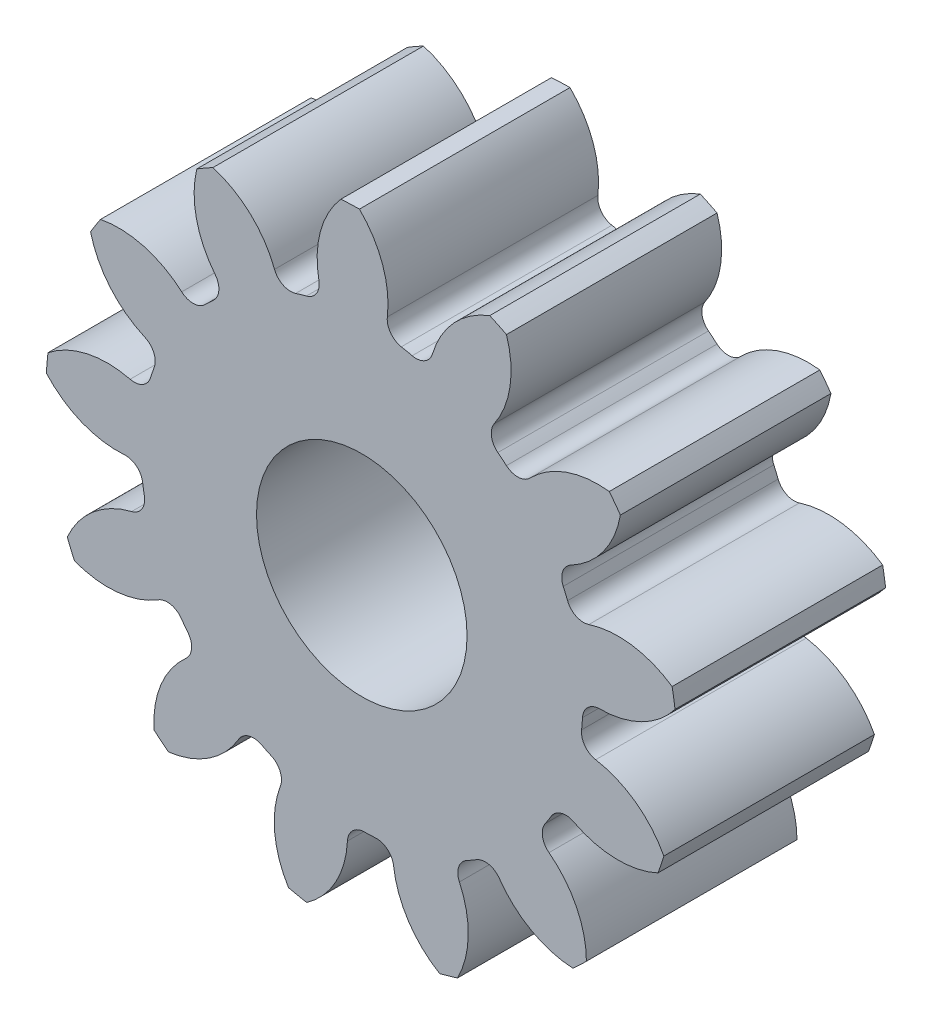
ISO-10303-21;
HEADER;
FILE_DESCRIPTION(('STEP AP214'),'2;1');
FILE_NAME('part.step','',(''),(''),'','','');
FILE_SCHEMA(('AUTOMOTIVE_DESIGN { 1 0 10303 214 1 1 1 1 }'));
ENDSEC;
DATA;
#1=APPLICATION_CONTEXT('core data for automotive mechanical design processes');
#2=APPLICATION_PROTOCOL_DEFINITION('international standard','automotive_design',2000,#1);
#3=PRODUCT_CONTEXT('',#1,'mechanical');
#4=PRODUCT('Part','Part','',(#3));
#5=PRODUCT_RELATED_PRODUCT_CATEGORY('part','',(#4));
#6=PRODUCT_DEFINITION_FORMATION('','',#4);
#7=PRODUCT_DEFINITION_CONTEXT('part definition',#1,'design');
#8=PRODUCT_DEFINITION('design','',#6,#7);
#9=PRODUCT_DEFINITION_SHAPE('','',#8);
#10=(LENGTH_UNIT() NAMED_UNIT(*) SI_UNIT(.MILLI.,.METRE.));
#11=(NAMED_UNIT(*) PLANE_ANGLE_UNIT() SI_UNIT($,.RADIAN.));
#12=(NAMED_UNIT(*) SI_UNIT($,.STERADIAN.) SOLID_ANGLE_UNIT());
#13=UNCERTAINTY_MEASURE_WITH_UNIT(LENGTH_MEASURE(1.E-05),#10,'distance_accuracy_value','');
#14=(GEOMETRIC_REPRESENTATION_CONTEXT(3) GLOBAL_UNCERTAINTY_ASSIGNED_CONTEXT((#13)) GLOBAL_UNIT_ASSIGNED_CONTEXT((#10,
#11,#12)) REPRESENTATION_CONTEXT('',''));
#15=CARTESIAN_POINT('',(0.,0.,0.));
#16=DIRECTION('',(0.,0.,1.));
#17=DIRECTION('',(1.,0.,0.));
#18=AXIS2_PLACEMENT_3D('',#15,#16,#17);
#19=CARTESIAN_POINT('',(0.,0.,101.6));
#20=DIRECTION('',(0.,0.,-1.));
#21=DIRECTION('',(-1.,0.,0.));
#22=AXIS2_PLACEMENT_3D('',#19,#20,#21);
#23=CYLINDRICAL_SURFACE('',#22,152.4);
#24=DIRECTION('',(0.,0.,-1.));
#25=VECTOR('',#24,1.);
#26=CARTESIAN_POINT('',(149.741194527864,28.3431589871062,50.8));
#27=LINE('',#26,#25);
#28=CARTESIAN_POINT('',(149.741194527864,28.3431589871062,101.6));
#29=VERTEX_POINT('',#28);
#30=CARTESIAN_POINT('',(149.741194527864,28.3431589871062,0.));
#31=VERTEX_POINT('',#30);
#32=EDGE_CURVE('E564',#29,#31,#27,.T.);
#33=ORIENTED_EDGE('',*,*,#32,.F.);
#34=CARTESIAN_POINT('',(0.,0.,101.6));
#35=DIRECTION('',(0.,0.,1.));
#36=DIRECTION('',(1.,0.,0.));
#37=AXIS2_PLACEMENT_3D('',#34,#35,#36);
#38=CIRCLE('',#37,152.4);
#39=CARTESIAN_POINT('',(151.148260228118,19.4926506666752,101.6));
#40=VERTEX_POINT('',#39);
#41=EDGE_CURVE('E1019',#40,#29,#38,.T.);
#42=ORIENTED_EDGE('',*,*,#41,.F.);
#43=DIRECTION('',(0.,0.,-1.));
#44=VECTOR('',#43,1.);
#45=CARTESIAN_POINT('',(151.148260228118,19.4926506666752,50.8));
#46=LINE('',#45,#44);
#47=CARTESIAN_POINT('',(151.148260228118,19.4926506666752,0.));
#48=VERTEX_POINT('',#47);
#49=EDGE_CURVE('E1013',#48,#40,#46,.F.);
#50=ORIENTED_EDGE('',*,*,#49,.F.);
#51=CARTESIAN_POINT('',(0.,0.,0.));
#52=DIRECTION('',(0.,0.,1.));
#53=DIRECTION('',(1.,0.,0.));
#54=AXIS2_PLACEMENT_3D('',#51,#52,#53);
#55=CIRCLE('',#54,152.4);
#56=EDGE_CURVE('E1024',#48,#31,#55,.T.);
#57=ORIENTED_EDGE('',*,*,#56,.T.);
#58=EDGE_LOOP('',(#33,#42,#50,#57));
#59=FACE_BOUND('',#58,.T.);
#60=ADVANCED_FACE('F33',(#59),#23,.T.);
#61=DIRECTION('',(0.,0.,-1.));
#62=VECTOR('',#61,1.);
#63=CARTESIAN_POINT('',(124.77645133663,87.5019839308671,50.8));
#64=LINE('',#63,#62);
#65=CARTESIAN_POINT('',(124.77645133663,87.5019839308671,0.));
#66=VERTEX_POINT('',#65);
#67=CARTESIAN_POINT('',(124.77645133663,87.5019839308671,101.6));
#68=VERTEX_POINT('',#67);
#69=EDGE_CURVE('E535',#66,#68,#64,.F.);
#70=ORIENTED_EDGE('',*,*,#69,.F.);
#71=CARTESIAN_POINT('',(119.417520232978,94.6848238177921,0.));
#72=VERTEX_POINT('',#71);
#73=EDGE_CURVE('E1027',#66,#72,#55,.T.);
#74=ORIENTED_EDGE('',*,*,#73,.T.);
#75=DIRECTION('',(0.,0.,-1.));
#76=VECTOR('',#75,1.);
#77=CARTESIAN_POINT('',(119.417520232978,94.6848238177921,50.8));
#78=LINE('',#77,#76);
#79=CARTESIAN_POINT('',(119.417520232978,94.6848238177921,101.6));
#80=VERTEX_POINT('',#79);
#81=EDGE_CURVE('E597',#80,#72,#78,.T.);
#82=ORIENTED_EDGE('',*,*,#81,.F.);
#83=EDGE_CURVE('E1022',#68,#80,#38,.T.);
#84=ORIENTED_EDGE('',*,*,#83,.F.);
#85=EDGE_LOOP('',(#70,#74,#82,#84));
#86=FACE_BOUND('',#85,.T.);
#87=ADVANCED_FACE('F1176',(#86),#23,.T.);
#88=CARTESIAN_POINT('',(0.,0.,101.6));
#89=DIRECTION('',(0.,0.,1.));
#90=DIRECTION('',(1.,0.,0.));
#91=AXIS2_PLACEMENT_3D('',#88,#89,#90);
#92=PLANE('',#91);
#93=CARTESIAN_POINT('',(0.,0.,101.599999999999));
#94=DIRECTION('',(0.,0.,1.));
#95=DIRECTION('',(1.,0.,0.));
#96=AXIS2_PLACEMENT_3D('',#93,#94,#95);
#97=CIRCLE('',#96,50.8);
#98=CARTESIAN_POINT('',(50.8,0.,101.599999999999));
#99=VERTEX_POINT('',#98);
#100=EDGE_CURVE('E552',#99,#99,#97,.T.);
#101=ORIENTED_EDGE('',*,*,#100,.F.);
#102=EDGE_LOOP('',(#101));
#103=FACE_BOUND('',#102,.T.);
#104=ORIENTED_EDGE('',*,*,#41,.T.);
#105=CARTESIAN_POINT('',(123.743253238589,-9.59382859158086,101.6));
#106=DIRECTION('',(0.,0.,-1.));
#107=DIRECTION('',(0.885456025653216,0.464723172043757,0.));
#108=AXIS2_PLACEMENT_3D('',#105,#106,#107);
#109=CIRCLE('',#108,45.9903030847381);
#110=CARTESIAN_POINT('',(109.548350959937,34.151030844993,101.6));
#111=VERTEX_POINT('',#110);
#112=EDGE_CURVE('E544',#111,#29,#109,.T.);
#113=ORIENTED_EDGE('',*,*,#112,.F.);
#114=CARTESIAN_POINT('',(106.995742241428,42.0174822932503,101.6));
#115=DIRECTION('',(0.,0.,1.));
#116=DIRECTION('',(-0.885456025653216,-0.464723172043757,0.));
#117=AXIS2_PLACEMENT_3D('',#114,#115,#116);
#118=CIRCLE('',#117,8.27024000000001);
#119=CARTESIAN_POINT('',(99.2977986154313,38.994481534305,101.6));
#120=VERTEX_POINT('',#119);
#121=EDGE_CURVE('E542',#120,#111,#118,.T.);
#122=ORIENTED_EDGE('',*,*,#121,.F.);
#123=CARTESIAN_POINT('',(0.,0.,101.6));
#124=DIRECTION('',(0.,0.,-1.));
#125=DIRECTION('',(0.885456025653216,0.464723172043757,0.));
#126=AXIS2_PLACEMENT_3D('',#123,#124,#125);
#127=CIRCLE('',#126,106.68);
#128=CARTESIAN_POINT('',(97.213958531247,43.9325467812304,101.6));
#129=VERTEX_POINT('',#128);
#130=EDGE_CURVE('E527',#129,#120,#127,.T.);
#131=ORIENTED_EDGE('',*,*,#130,.F.);
#132=CARTESIAN_POINT('',(104.750354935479,47.3383651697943,101.6));
#133=DIRECTION('',(0.,0.,1.));
#134=DIRECTION('',(-0.885456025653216,-0.464723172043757,0.));
#135=AXIS2_PLACEMENT_3D('',#132,#133,#134);
#136=CIRCLE('',#135,8.27024000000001);
#137=CARTESIAN_POINT('',(100.895633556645,54.6553312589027,101.6));
#138=VERTEX_POINT('',#137);
#139=EDGE_CURVE('E519',#138,#129,#136,.T.);
#140=ORIENTED_EDGE('',*,*,#139,.F.);
#141=CARTESIAN_POINT('',(79.4597617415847,95.3445359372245,101.6));
#142=DIRECTION('',(0.,0.,-1.));
#143=DIRECTION('',(-0.885456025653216,-0.464723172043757,0.));
#144=AXIS2_PLACEMENT_3D('',#141,#142,#143);
#145=CIRCLE('',#144,45.9903030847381);
#146=EDGE_CURVE('E549',#68,#138,#145,.T.);
#147=ORIENTED_EDGE('',*,*,#146,.F.);
#148=ORIENTED_EDGE('',*,*,#83,.T.);
#149=CARTESIAN_POINT('',(114.027683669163,49.0114438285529,101.6));
#150=DIRECTION('',(0.,0.,-1.));
#151=DIRECTION('',(0.568064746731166,0.822983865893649,0.));
#152=AXIS2_PLACEMENT_3D('',#149,#150,#151);
#153=CIRCLE('',#152,45.9903030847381);
#154=CARTESIAN_POINT('',(81.1294720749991,81.1488931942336,101.6));
#155=VERTEX_POINT('',#154);
#156=EDGE_CURVE('E573',#155,#80,#153,.T.);
#157=ORIENTED_EDGE('',*,*,#156,.F.);
#158=CARTESIAN_POINT('',(75.2135270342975,86.9280336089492,101.6));
#159=DIRECTION('',(0.,0.,1.));
#160=DIRECTION('',(-0.568064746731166,-0.822983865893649,0.));
#161=AXIS2_PLACEMENT_3D('',#158,#159,#160);
#162=CIRCLE('',#161,8.27024000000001);
#163=CARTESIAN_POINT('',(69.8021949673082,80.6738865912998,101.6));
#164=VERTEX_POINT('',#163);
#165=EDGE_CURVE('E571',#164,#155,#162,.T.);
#166=ORIENTED_EDGE('',*,*,#165,.F.);
#167=CARTESIAN_POINT('',(0.,0.,101.6));
#168=DIRECTION('',(0.,0.,-1.));
#169=DIRECTION('',(0.568064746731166,0.822983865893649,0.));
#170=AXIS2_PLACEMENT_3D('',#167,#168,#169);
#171=CIRCLE('',#170,106.68);
#172=CARTESIAN_POINT('',(65.6622128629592,84.0779174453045,101.6));
#173=VERTEX_POINT('',#172);
#174=EDGE_CURVE('E568',#173,#164,#171,.T.);
#175=ORIENTED_EDGE('',*,*,#174,.F.);
#176=CARTESIAN_POINT('',(70.7525977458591,90.5959579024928,101.6));
#177=DIRECTION('',(0.,0.,1.));
#178=DIRECTION('',(-0.568064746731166,-0.822983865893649,0.));
#179=AXIS2_PLACEMENT_3D('',#176,#177,#178);
#180=CIRCLE('',#179,8.27024000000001);
#181=CARTESIAN_POINT('',(63.9390477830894,95.2834312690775,101.6));
#182=VERTEX_POINT('',#181);
#183=EDGE_CURVE('E566',#182,#173,#180,.T.);
#184=ORIENTED_EDGE('',*,*,#183,.F.);
#185=CARTESIAN_POINT('',(26.0493096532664,121.350186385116,101.6));
#186=DIRECTION('',(0.,0.,-1.));
#187=DIRECTION('',(-0.568064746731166,-0.822983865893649,0.));
#188=AXIS2_PLACEMENT_3D('',#185,#186,#187);
#189=CIRCLE('',#188,45.9903030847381);
#190=CARTESIAN_POINT('',(69.8198611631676,135.46566718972,101.6));
#191=VERTEX_POINT('',#190);
#192=EDGE_CURVE('E576',#191,#182,#189,.T.);
#193=ORIENTED_EDGE('',*,*,#192,.F.);
#194=CARTESIAN_POINT('',(61.7367311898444,139.335336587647,101.6));
#195=VERTEX_POINT('',#194);
#196=EDGE_CURVE('E1061',#191,#195,#38,.T.);
#197=ORIENTED_EDGE('',*,*,#196,.T.);
#198=CARTESIAN_POINT('',(78.1897459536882,96.388785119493,101.6));
#199=DIRECTION('',(0.,0.,-1.));
#200=DIRECTION('',(0.120536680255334,0.992708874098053,0.));
#201=AXIS2_PLACEMENT_3D('',#198,#199,#200);
#202=CIRCLE('',#201,45.9903030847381);
#203=CARTESIAN_POINT('',(34.1248088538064,109.556522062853,101.6));
#204=VERTEX_POINT('',#203);
#205=EDGE_CURVE('E608',#204,#195,#202,.T.);
#206=ORIENTED_EDGE('',*,*,#205,.F.);
#207=CARTESIAN_POINT('',(26.200799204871,111.924420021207,101.6));
#208=DIRECTION('',(0.,0.,1.));
#209=DIRECTION('',(-0.120536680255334,-0.992708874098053,0.));
#210=AXIS2_PLACEMENT_3D('',#207,#208,#209);
#211=CIRCLE('',#210,8.27024000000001);
#212=CARTESIAN_POINT('',(24.3157496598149,103.871876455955,101.6));
#213=VERTEX_POINT('',#212);
#214=EDGE_CURVE('E606',#213,#204,#211,.T.);
#215=ORIENTED_EDGE('',*,*,#214,.F.);
#216=CARTESIAN_POINT('',(0.,0.,101.6));
#217=DIRECTION('',(0.,0.,-1.));
#218=DIRECTION('',(0.120536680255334,0.992708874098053,0.));
#219=AXIS2_PLACEMENT_3D('',#216,#217,#218);
#220=CIRCLE('',#219,106.68);
#221=CARTESIAN_POINT('',(19.0680455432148,104.962050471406,101.6));
#222=VERTEX_POINT('',#221);
#223=EDGE_CURVE('E603',#222,#213,#220,.T.);
#224=ORIENTED_EDGE('',*,*,#223,.F.);
#225=CARTESIAN_POINT('',(20.5462730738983,113.099108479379,101.6));
#226=DIRECTION('',(0.,0.,1.));
#227=DIRECTION('',(-0.120536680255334,-0.992708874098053,0.));
#228=AXIS2_PLACEMENT_3D('',#225,#226,#227);
#229=CIRCLE('',#228,8.27024000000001);
#230=CARTESIAN_POINT('',(12.3347967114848,114.083245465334,101.6));
#231=VERTEX_POINT('',#230);
#232=EDGE_CURVE('E601',#231,#222,#229,.T.);
#233=ORIENTED_EDGE('',*,*,#232,.F.);
#234=CARTESIAN_POINT('',(-33.3287253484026,119.555971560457,101.6));
#235=DIRECTION('',(0.,0.,-1.));
#236=DIRECTION('',(-0.120536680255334,-0.992708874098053,0.));
#237=AXIS2_PLACEMENT_3D('',#234,#235,#236);
#238=CIRCLE('',#237,45.9903030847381);
#239=CARTESIAN_POINT('',(-1.13161778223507,152.395798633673,101.6));
#240=VERTEX_POINT('',#239);
#241=EDGE_CURVE('E611',#240,#231,#238,.T.);
#242=ORIENTED_EDGE('',*,*,#241,.F.);
#243=CARTESIAN_POINT('',(-10.0871989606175,152.065802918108,101.6));
#244=VERTEX_POINT('',#243);
#245=EDGE_CURVE('E1158',#240,#244,#38,.T.);
#246=ORIENTED_EDGE('',*,*,#245,.T.);
#247=CARTESIAN_POINT('',(24.4394797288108,121.684617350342,101.6));
#248=DIRECTION('',(0.,0.,-1.));
#249=DIRECTION('',(-0.354604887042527,0.935016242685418,0.));
#250=AXIS2_PLACEMENT_3D('',#247,#248,#249);
#251=CIRCLE('',#250,45.9903030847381);
#252=CARTESIAN_POINT('',(-20.6974368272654,112.86607202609,101.6));
#253=VERTEX_POINT('',#252);
#254=EDGE_CURVE('E646',#253,#244,#251,.T.);
#255=ORIENTED_EDGE('',*,*,#254,.F.);
#256=CARTESIAN_POINT('',(-28.8142159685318,111.280270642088,101.6));
#257=DIRECTION('',(0.,0.,1.));
#258=DIRECTION('',(0.354604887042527,-0.935016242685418,0.));
#259=AXIS2_PLACEMENT_3D('',#256,#257,#258);
#260=CIRCLE('',#259,8.27024000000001);
#261=CARTESIAN_POINT('',(-26.7411408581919,103.274071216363,101.6));
#262=VERTEX_POINT('',#261);
#263=EDGE_CURVE('E644',#262,#253,#260,.T.);
#264=ORIENTED_EDGE('',*,*,#263,.F.);
#265=CARTESIAN_POINT('',(0.,0.,101.6));
#266=DIRECTION('',(0.,0.,-1.));
#267=DIRECTION('',(-0.354604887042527,0.935016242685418,0.));
#268=AXIS2_PLACEMENT_3D('',#265,#266,#267);
#269=CIRCLE('',#268,106.68);
#270=CARTESIAN_POINT('',(-31.8943812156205,101.80064266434,101.6));
#271=VERTEX_POINT('',#270);
#272=EDGE_CURVE('E641',#271,#262,#269,.T.);
#273=ORIENTED_EDGE('',*,*,#272,.F.);
#274=CARTESIAN_POINT('',(-34.36695514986,109.692616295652,101.6));
#275=DIRECTION('',(0.,0.,1.));
#276=DIRECTION('',(0.354604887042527,-0.935016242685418,0.));
#277=AXIS2_PLACEMENT_3D('',#274,#275,#276);
#278=CIRCLE('',#277,8.27024000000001);
#279=CARTESIAN_POINT('',(-42.0952076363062,106.74796297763,101.6));
#280=VERTEX_POINT('',#279);
#281=EDGE_CURVE('E639',#280,#271,#278,.T.);
#282=ORIENTED_EDGE('',*,*,#281,.F.);
#283=CARTESIAN_POINT('',(-85.0715510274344,90.3729244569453,101.6));
#284=DIRECTION('',(0.,0.,-1.));
#285=DIRECTION('',(0.354604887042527,-0.935016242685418,0.));
#286=AXIS2_PLACEMENT_3D('',#283,#284,#285);
#287=CIRCLE('',#286,45.9903030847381);
#288=CARTESIAN_POINT('',(-71.8238567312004,134.413889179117,101.6));
#289=VERTEX_POINT('',#288);
#290=EDGE_CURVE('E649',#289,#280,#287,.T.);
#291=ORIENTED_EDGE('',*,*,#290,.F.);
#292=CARTESIAN_POINT('',(-79.6002733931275,129.959826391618,101.6));
#293=VERTEX_POINT('',#292);
#294=EDGE_CURVE('E1154',#289,#293,#38,.T.);
#295=ORIENTED_EDGE('',*,*,#294,.T.);
#296=CARTESIAN_POINT('',(-34.9095767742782,119.103970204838,101.6));
#297=DIRECTION('',(0.,0.,-1.));
#298=DIRECTION('',(-0.748510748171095,0.663122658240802,0.));
#299=AXIS2_PLACEMENT_3D('',#296,#297,#298);
#300=CIRCLE('',#299,45.9903030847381);
#301=CARTESIAN_POINT('',(-70.7781491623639,90.3193650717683,101.6));
#302=VERTEX_POINT('',#301);
#303=EDGE_CURVE('E684',#302,#293,#300,.T.);
#304=ORIENTED_EDGE('',*,*,#303,.F.);
#305=CARTESIAN_POINT('',(-77.2282415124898,85.1431523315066,101.6));
#306=DIRECTION('',(0.,0.,1.));
#307=DIRECTION('',(0.748510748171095,-0.663122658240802,0.));
#308=AXIS2_PLACEMENT_3D('',#305,#306,#307);
#309=CIRCLE('',#308,8.27024000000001);
#310=CARTESIAN_POINT('',(-71.6719582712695,79.0174208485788,101.6));
#311=VERTEX_POINT('',#310);
#312=EDGE_CURVE('E682',#311,#302,#309,.T.);
#313=ORIENTED_EDGE('',*,*,#312,.F.);
#314=CARTESIAN_POINT('',(0.,0.,101.6));
#315=DIRECTION('',(0.,0.,-1.));
#316=DIRECTION('',(-0.748510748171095,0.663122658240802,0.));
#317=AXIS2_PLACEMENT_3D('',#314,#315,#316);
#318=CIRCLE('',#317,106.68);
#319=CARTESIAN_POINT('',(-75.5501896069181,75.3179344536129,101.6));
#320=VERTEX_POINT('',#319);
#321=EDGE_CURVE('E679',#320,#311,#318,.T.);
#322=ORIENTED_EDGE('',*,*,#321,.F.);
#323=CARTESIAN_POINT('',(-81.4071281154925,81.1568676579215,101.6));
#324=DIRECTION('',(0.,0.,1.));
#325=DIRECTION('',(0.748510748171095,-0.663122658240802,0.));
#326=AXIS2_PLACEMENT_3D('',#323,#324,#325);
#327=CIRCLE('',#326,8.27024000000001);
#328=CARTESIAN_POINT('',(-86.8817072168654,74.9580086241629,101.6));
#329=VERTEX_POINT('',#328);
#330=EDGE_CURVE('E677',#329,#320,#327,.T.);
#331=ORIENTED_EDGE('',*,*,#330,.F.);
#332=CARTESIAN_POINT('',(-117.32550958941,40.4865294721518,101.6));
#333=DIRECTION('',(0.,0.,-1.));
#334=DIRECTION('',(0.748510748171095,-0.663122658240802,0.));
#335=AXIS2_PLACEMENT_3D('',#332,#333,#334);
#336=CIRCLE('',#335,45.9903030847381);
#337=CARTESIAN_POINT('',(-126.062115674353,85.6393775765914,101.6));
#338=VERTEX_POINT('',#337);
#339=EDGE_CURVE('E687',#338,#329,#336,.T.);
#340=ORIENTED_EDGE('',*,*,#339,.F.);
#341=CARTESIAN_POINT('',(-130.877884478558,78.0816198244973,101.6));
#342=VERTEX_POINT('',#341);
#343=EDGE_CURVE('E1150',#338,#342,#38,.T.);
#344=ORIENTED_EDGE('',*,*,#343,.T.);
#345=CARTESIAN_POINT('',(-86.2612699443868,89.2380388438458,101.6));
#346=DIRECTION('',(0.,0.,-1.));
#347=DIRECTION('',(-0.97094181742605,0.239315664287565,0.));
#348=AXIS2_PLACEMENT_3D('',#345,#346,#347);
#349=CIRCLE('',#348,45.9903030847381);
#350=CARTESIAN_POINT('',(-104.644440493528,47.0815800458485,101.6));
#351=VERTEX_POINT('',#350);
#352=EDGE_CURVE('E722',#351,#342,#349,.T.);
#353=ORIENTED_EDGE('',*,*,#352,.F.);
#354=CARTESIAN_POINT('',(-107.950207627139,39.5007639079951,101.6));
#355=DIRECTION('',(0.,0.,1.));
#356=DIRECTION('',(0.97094181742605,-0.239315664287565,0.));
#357=AXIS2_PLACEMENT_3D('',#354,#355,#356);
#358=CIRCLE('',#357,8.27024000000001);
#359=CARTESIAN_POINT('',(-100.18359378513,36.6588316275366,101.6));
#360=VERTEX_POINT('',#359);
#361=EDGE_CURVE('E720',#360,#351,#358,.T.);
#362=ORIENTED_EDGE('',*,*,#361,.F.);
#363=CARTESIAN_POINT('',(0.,0.,101.6));
#364=DIRECTION('',(0.,0.,-1.));
#365=DIRECTION('',(-0.97094181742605,0.239315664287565,0.));
#366=AXIS2_PLACEMENT_3D('',#363,#364,#365);
#367=CIRCLE('',#366,106.68);
#368=CARTESIAN_POINT('',(-101.898360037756,31.5807951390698,101.6));
#369=VERTEX_POINT('',#368);
#370=EDGE_CURVE('E717',#369,#360,#367,.T.);
#371=ORIENTED_EDGE('',*,*,#370,.F.);
#372=CARTESIAN_POINT('',(-109.797909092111,34.0290586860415,101.6));
#373=DIRECTION('',(0.,0.,1.));
#374=DIRECTION('',(0.97094181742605,-0.239315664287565,0.));
#375=AXIS2_PLACEMENT_3D('',#372,#373,#374);
#376=CIRCLE('',#375,8.27024000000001);
#377=CARTESIAN_POINT('',(-111.764654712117,25.9960778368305,101.6));
#378=VERTEX_POINT('',#377);
#379=EDGE_CURVE('E715',#378,#369,#376,.T.);
#380=ORIENTED_EDGE('',*,*,#379,.F.);
#381=CARTESIAN_POINT('',(-122.701607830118,-18.6748414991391,101.6));
#382=DIRECTION('',(0.,0.,-1.));
#383=DIRECTION('',(0.97094181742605,-0.239315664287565,0.));
#384=AXIS2_PLACEMENT_3D('',#381,#382,#383);
#385=CIRCLE('',#384,45.9903030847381);
#386=CARTESIAN_POINT('',(-151.421063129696,17.2459166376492,101.6));
#387=VERTEX_POINT('',#386);
#388=EDGE_CURVE('E725',#387,#378,#385,.T.);
#389=ORIENTED_EDGE('',*,*,#388,.F.);
#390=CARTESIAN_POINT('',(-152.17294947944,8.31585514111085,101.6));
#391=VERTEX_POINT('',#390);
#392=EDGE_CURVE('E1146',#387,#391,#38,.T.);
#393=ORIENTED_EDGE('',*,*,#392,.T.);
#394=CARTESIAN_POINT('',(-117.851545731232,38.9287482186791,101.6));
#395=DIRECTION('',(0.,0.,-1.));
#396=DIRECTION('',(-0.970941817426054,-0.239315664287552,0.));
#397=AXIS2_PLACEMENT_3D('',#394,#395,#396);
#398=CIRCLE('',#397,45.9903030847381);
#399=CARTESIAN_POINT('',(-114.537951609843,-6.9420275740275,101.6));
#400=VERTEX_POINT('',#399);
#401=EDGE_CURVE('E760',#400,#391,#398,.T.);
#402=ORIENTED_EDGE('',*,*,#401,.F.);
#403=CARTESIAN_POINT('',(-113.942082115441,-15.1907734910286,101.6));
#404=DIRECTION('',(0.,0.,1.));
#405=DIRECTION('',(0.970941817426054,0.239315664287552,0.));
#406=AXIS2_PLACEMENT_3D('',#403,#404,#405);
#407=CIRCLE('',#406,8.27024000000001);
#408=CARTESIAN_POINT('',(-105.744375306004,-14.0978541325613,101.6));
#409=VERTEX_POINT('',#408);
#410=EDGE_CURVE('E758',#409,#400,#407,.T.);
#411=ORIENTED_EDGE('',*,*,#410,.F.);
#412=CARTESIAN_POINT('',(0.,0.,101.6));
#413=DIRECTION('',(0.,0.,-1.));
#414=DIRECTION('',(-0.970941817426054,-0.239315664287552,0.));
#415=AXIS2_PLACEMENT_3D('',#412,#413,#414);
#416=CIRCLE('',#415,106.68);
#417=CARTESIAN_POINT('',(-104.902844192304,-19.3911237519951,101.6));
#418=VERTEX_POINT('',#417);
#419=EDGE_CURVE('E755',#418,#409,#416,.T.);
#420=ORIENTED_EDGE('',*,*,#419,.F.);
#421=CARTESIAN_POINT('',(-113.035312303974,-20.8943975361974,101.6));
#422=DIRECTION('',(0.,0.,1.));
#423=DIRECTION('',(0.970941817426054,0.239315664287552,0.));
#424=AXIS2_PLACEMENT_3D('',#421,#422,#423);
#425=CIRCLE('',#424,8.27024000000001);
#426=CARTESIAN_POINT('',(-111.043666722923,-28.9212410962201,101.6));
#427=VERTEX_POINT('',#426);
#428=EDGE_CURVE('E753',#427,#418,#425,.T.);
#429=ORIENTED_EDGE('',*,*,#428,.F.);
#430=CARTESIAN_POINT('',(-99.9682464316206,-73.5580313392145,101.6));
#431=DIRECTION('',(0.,0.,-1.));
#432=DIRECTION('',(0.970941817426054,0.239315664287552,0.));
#433=AXIS2_PLACEMENT_3D('',#430,#431,#432);
#434=CIRCLE('',#433,45.9903030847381);
#435=CARTESIAN_POINT('',(-142.091269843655,-55.0983759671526,101.6));
#436=VERTEX_POINT('',#435);
#437=EDGE_CURVE('E763',#436,#427,#434,.T.);
#438=ORIENTED_EDGE('',*,*,#437,.F.);
#439=CARTESIAN_POINT('',(-138.607025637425,-63.3549717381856,101.6));
#440=VERTEX_POINT('',#439);
#441=EDGE_CURVE('E1142',#436,#440,#38,.T.);
#442=ORIENTED_EDGE('',*,*,#441,.T.);
#443=CARTESIAN_POINT('',(-122.443452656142,-20.2986494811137,101.6));
#444=DIRECTION('',(0.,0.,-1.));
#445=DIRECTION('',(-0.748510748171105,-0.663122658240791,0.));
#446=AXIS2_PLACEMENT_3D('',#443,#444,#445);
#447=CIRCLE('',#446,45.9903030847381);
#448=CARTESIAN_POINT('',(-98.1921983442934,-59.3753003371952,101.6));
#449=VERTEX_POINT('',#448);
#450=EDGE_CURVE('E798',#449,#440,#447,.T.);
#451=ORIENTED_EDGE('',*,*,#450,.F.);
#452=CARTESIAN_POINT('',(-93.8311987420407,-66.4022877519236,101.6));
#453=DIRECTION('',(0.,0.,1.));
#454=DIRECTION('',(0.748510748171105,0.663122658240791,0.));
#455=AXIS2_PLACEMENT_3D('',#452,#453,#454);
#456=CIRCLE('',#455,8.27024000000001);
#457=CARTESIAN_POINT('',(-87.0803948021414,-61.6248914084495,101.6));
#458=VERTEX_POINT('',#457);
#459=EDGE_CURVE('E796',#458,#449,#456,.T.);
#460=ORIENTED_EDGE('',*,*,#459,.F.);
#461=CARTESIAN_POINT('',(0.,0.,101.6));
#462=DIRECTION('',(0.,0.,-1.));
#463=DIRECTION('',(-0.748510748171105,-0.663122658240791,0.));
#464=AXIS2_PLACEMENT_3D('',#461,#462,#463);
#465=CIRCLE('',#464,106.68);
#466=CARTESIAN_POINT('',(-83.875350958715,-65.9207698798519,101.6));
#467=VERTEX_POINT('',#466);
#468=EDGE_CURVE('E793',#467,#458,#465,.T.);
#469=ORIENTED_EDGE('',*,*,#468,.F.);
#470=CARTESIAN_POINT('',(-90.377687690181,-71.0311990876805,101.6));
#471=DIRECTION('',(0.,0.,1.));
#472=DIRECTION('',(0.748510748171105,0.663122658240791,0.));
#473=AXIS2_PLACEMENT_3D('',#470,#471,#472);
#474=CIRCLE('',#473,8.27024000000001);
#475=CARTESIAN_POINT('',(-84.8839129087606,-77.2130522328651,101.6));
#476=VERTEX_POINT('',#475);
#477=EDGE_CURVE('E791',#476,#467,#474,.T.);
#478=ORIENTED_EDGE('',*,*,#477,.F.);
#479=CARTESIAN_POINT('',(-54.3333645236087,-111.589962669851,101.6));
#480=DIRECTION('',(0.,0.,-1.));
#481=DIRECTION('',(0.748510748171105,0.663122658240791,0.));
#482=AXIS2_PLACEMENT_3D('',#479,#480,#481);
#483=CIRCLE('',#482,45.9903030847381);
#484=CARTESIAN_POINT('',(-100.210079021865,-114.820294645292,101.6));
#485=VERTEX_POINT('',#484);
#486=EDGE_CURVE('E801',#485,#476,#483,.T.);
#487=ORIENTED_EDGE('',*,*,#486,.F.);
#488=CARTESIAN_POINT('',(-93.2879026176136,-120.511938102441,101.6));
#489=VERTEX_POINT('',#488);
#490=EDGE_CURVE('E1138',#485,#489,#38,.T.);
#491=ORIENTED_EDGE('',*,*,#490,.T.);
#492=CARTESIAN_POINT('',(-98.985040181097,-74.8758712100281,101.6));
#493=DIRECTION('',(0.,0.,-1.));
#494=DIRECTION('',(-0.35460488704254,-0.935016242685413,0.));
#495=AXIS2_PLACEMENT_3D('',#492,#493,#494);
#496=CIRCLE('',#495,45.9903030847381);
#497=CARTESIAN_POINT('',(-59.3517957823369,-98.2064073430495,101.6));
#498=VERTEX_POINT('',#497);
#499=EDGE_CURVE('E836',#498,#489,#496,.T.);
#500=ORIENTED_EDGE('',*,*,#499,.F.);
#501=CARTESIAN_POINT('',(-52.2247185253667,-102.40183812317,101.6));
#502=DIRECTION('',(0.,0.,1.));
#503=DIRECTION('',(0.35460488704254,0.935016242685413,0.));
#504=AXIS2_PLACEMENT_3D('',#501,#502,#503);
#505=CIRCLE('',#504,8.27024000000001);
#506=CARTESIAN_POINT('',(-48.4673452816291,-95.0344087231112,101.6));
#507=VERTEX_POINT('',#506);
#508=EDGE_CURVE('E834',#507,#498,#505,.T.);
#509=ORIENTED_EDGE('',*,*,#508,.F.);
#510=CARTESIAN_POINT('',(0.,0.,101.6));
#511=DIRECTION('',(0.,0.,-1.));
#512=DIRECTION('',(-0.35460488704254,-0.935016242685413,0.));
#513=AXIS2_PLACEMENT_3D('',#510,#511,#512);
#514=CIRCLE('',#513,106.68);
#515=CARTESIAN_POINT('',(-43.6330256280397,-97.3487620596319,101.6));
#516=VERTEX_POINT('',#515);
#517=EDGE_CURVE('E831',#516,#507,#514,.T.);
#518=ORIENTED_EDGE('',*,*,#517,.F.);
#519=CARTESIAN_POINT('',(-47.0156239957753,-104.895608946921,101.6));
#520=DIRECTION('',(0.,0.,1.));
#521=DIRECTION('',(0.35460488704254,0.935016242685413,0.));
#522=AXIS2_PLACEMENT_3D('',#519,#520,#521);
#523=CIRCLE('',#522,8.27024000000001);
#524=CARTESIAN_POINT('',(-39.278277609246,-107.816283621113,101.6));
#525=VERTEX_POINT('',#524);
#526=EDGE_CURVE('E829',#525,#516,#523,.T.);
#527=ORIENTED_EDGE('',*,*,#526,.F.);
#528=CARTESIAN_POINT('',(3.74863640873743,-124.057978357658,101.6));
#529=DIRECTION('',(0.,0.,-1.));
#530=DIRECTION('',(0.35460488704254,0.935016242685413,0.));
#531=AXIS2_PLACEMENT_3D('',#528,#529,#530);
#532=CIRCLE('',#531,45.9903030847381);
#533=CARTESIAN_POINT('',(-35.3719667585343,-148.238267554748,101.6));
#534=VERTEX_POINT('',#533);
#535=EDGE_CURVE('E839',#534,#525,#532,.T.);
#536=ORIENTED_EDGE('',*,*,#535,.F.);
#537=CARTESIAN_POINT('',(-26.5976453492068,-150.061071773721,101.6));
#538=VERTEX_POINT('',#537);
#539=EDGE_CURVE('E1134',#534,#538,#38,.T.);
#540=ORIENTED_EDGE('',*,*,#539,.T.);
#541=CARTESIAN_POINT('',(-52.8503478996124,-112.299933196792,101.6));
#542=DIRECTION('',(0.,0.,-1.));
#543=DIRECTION('',(0.12053668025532,-0.992708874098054,0.));
#544=AXIS2_PLACEMENT_3D('',#541,#542,#543);
#545=CIRCLE('',#544,45.9903030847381);
#546=CARTESIAN_POINT('',(-6.91461207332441,-114.539609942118,101.6));
#547=VERTEX_POINT('',#546);
#548=EDGE_CURVE('E874',#547,#538,#545,.T.);
#549=ORIENTED_EDGE('',*,*,#548,.F.);
#550=CARTESIAN_POINT('',(1.34581532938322,-114.942361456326,101.6));
#551=DIRECTION('',(0.,0.,1.));
#552=DIRECTION('',(-0.12053668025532,0.992708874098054,0.));
#553=AXIS2_PLACEMENT_3D('',#550,#551,#552);
#554=CIRCLE('',#553,8.27024000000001);
#555=CARTESIAN_POINT('',(1.24898894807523,-106.672688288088,101.6));
#556=VERTEX_POINT('',#555);
#557=EDGE_CURVE('E872',#556,#547,#554,.T.);
#558=ORIENTED_EDGE('',*,*,#557,.F.);
#559=CARTESIAN_POINT('',(0.,0.,101.6));
#560=DIRECTION('',(0.,0.,-1.));
#561=DIRECTION('',(0.12053668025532,-0.992708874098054,0.));
#562=AXIS2_PLACEMENT_3D('',#559,#560,#561);
#563=CIRCLE('',#562,106.68);
#564=CARTESIAN_POINT('',(6.60510003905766,-106.475326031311,101.6));
#565=VERTEX_POINT('',#564);
#566=EDGE_CURVE('E869',#565,#556,#563,.T.);
#567=ORIENTED_EDGE('',*,*,#566,.F.);
#568=CARTESIAN_POINT('',(7.11715255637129,-114.729698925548,101.6));
#569=DIRECTION('',(0.,0.,1.));
#570=DIRECTION('',(-0.12053668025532,0.992708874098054,0.));
#571=AXIS2_PLACEMENT_3D('',#568,#569,#570);
#572=CIRCLE('',#571,8.27024000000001);
#573=CARTESIAN_POINT('',(15.3255377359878,-113.720103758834,101.6));
#574=VERTEX_POINT('',#573);
#575=EDGE_CURVE('E867',#574,#565,#572,.T.);
#576=ORIENTED_EDGE('',*,*,#575,.F.);
#577=CARTESIAN_POINT('',(60.9718699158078,-108.105806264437,101.6));
#578=DIRECTION('',(0.,0.,-1.));
#579=DIRECTION('',(-0.12053668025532,0.992708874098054,0.));
#580=AXIS2_PLACEMENT_3D('',#577,#578,#579);
#581=CIRCLE('',#580,45.9903030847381);
#582=CARTESIAN_POINT('',(37.5694368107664,-147.696639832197,101.6));
#583=VERTEX_POINT('',#582);
#584=EDGE_CURVE('E877',#583,#574,#581,.T.);
#585=ORIENTED_EDGE('',*,*,#584,.F.);
#586=CARTESIAN_POINT('',(46.1858119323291,-145.233022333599,101.6));
#587=VERTEX_POINT('',#586);
#588=EDGE_CURVE('E1130',#583,#587,#38,.T.);
#589=ORIENTED_EDGE('',*,*,#588,.T.);
#590=CARTESIAN_POINT('',(5.39172216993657,-123.997433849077,101.6));
#591=DIRECTION('',(0.,0.,-1.));
#592=DIRECTION('',(0.568064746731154,-0.822983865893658,0.));
#593=AXIS2_PLACEMENT_3D('',#590,#591,#592);
#594=CIRCLE('',#593,45.9903030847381);
#595=CARTESIAN_POINT('',(47.1066259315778,-104.633168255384,101.6));
#596=VERTEX_POINT('',#595);
#597=EDGE_CURVE('E912',#596,#587,#594,.T.);
#598=ORIENTED_EDGE('',*,*,#597,.F.);
#599=CARTESIAN_POINT('',(54.6080391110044,-101.150974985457,101.6));
#600=DIRECTION('',(0.,0.,1.));
#601=DIRECTION('',(-0.568064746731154,0.822983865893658,0.));
#602=AXIS2_PLACEMENT_3D('',#599,#600,#601);
#603=CIRCLE('',#602,8.27024000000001);
#604=CARTESIAN_POINT('',(50.679194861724,-93.8735405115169,101.6));
#605=VERTEX_POINT('',#604);
#606=EDGE_CURVE('E910',#605,#596,#603,.T.);
#607=ORIENTED_EDGE('',*,*,#606,.F.);
#608=CARTESIAN_POINT('',(0.,0.,101.6));
#609=DIRECTION('',(0.,0.,-1.));
#610=DIRECTION('',(0.568064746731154,-0.822983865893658,0.));
#611=AXIS2_PLACEMENT_3D('',#608,#609,#610);
#612=CIRCLE('',#611,106.68);
#613=CARTESIAN_POINT('',(55.3300768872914,-91.2096759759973,101.6));
#614=VERTEX_POINT('',#613);
#615=EDGE_CURVE('E907',#614,#605,#612,.T.);
#616=ORIENTED_EDGE('',*,*,#615,.F.);
#617=CARTESIAN_POINT('',(59.6194752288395,-98.2805975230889,101.6));
#618=DIRECTION('',(0.,0.,1.));
#619=DIRECTION('',(-0.568064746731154,0.822983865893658,0.));
#620=AXIS2_PLACEMENT_3D('',#617,#618,#619);
#621=CIRCLE('',#620,8.27024000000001);
#622=CARTESIAN_POINT('',(66.418457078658,-93.5720186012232,101.6));
#623=VERTEX_POINT('',#622);
#624=EDGE_CURVE('E905',#623,#614,#621,.T.);
#625=ORIENTED_EDGE('',*,*,#624,.F.);
#626=CARTESIAN_POINT('',(104.227182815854,-67.3878967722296,101.6));
#627=DIRECTION('',(0.,0.,-1.));
#628=DIRECTION('',(-0.568064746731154,0.822983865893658,0.));
#629=AXIS2_PLACEMENT_3D('',#626,#627,#628);
#630=CIRCLE('',#629,45.9903030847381);
#631=CARTESIAN_POINT('',(101.904135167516,-113.319491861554,101.6));
#632=VERTEX_POINT('',#631);
#633=EDGE_CURVE('E915',#632,#623,#630,.T.);
#634=ORIENTED_EDGE('',*,*,#633,.F.);
#635=CARTESIAN_POINT('',(108.38865629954,-107.133837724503,101.6));
#636=VERTEX_POINT('',#635);
#637=EDGE_CURVE('E1129',#632,#636,#38,.T.);
#638=ORIENTED_EDGE('',*,*,#637,.T.);
#639=CARTESIAN_POINT('',(62.398613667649,-107.288616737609,101.6));
#640=DIRECTION('',(0.,0.,-1.));
#641=DIRECTION('',(0.885456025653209,-0.46472317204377,0.));
#642=AXIS2_PLACEMENT_3D('',#639,#640,#641);
#643=CIRCLE('',#642,45.9903030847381);
#644=CARTESIAN_POINT('',(90.336303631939,-70.7565286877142,101.6));
#645=VERTEX_POINT('',#644);
#646=EDGE_CURVE('E950',#645,#636,#643,.T.);
#647=ORIENTED_EDGE('',*,*,#646,.F.);
#648=CARTESIAN_POINT('',(95.3602192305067,-64.1871191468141,101.6));
#649=DIRECTION('',(0.,0.,1.));
#650=DIRECTION('',(-0.885456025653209,0.46472317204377,0.));
#651=AXIS2_PLACEMENT_3D('',#648,#649,#650);
#652=CIRCLE('',#651,8.27024000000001);
#653=CARTESIAN_POINT('',(88.4994079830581,-59.5690959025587,101.6));
#654=VERTEX_POINT('',#653);
#655=EDGE_CURVE('E948',#654,#645,#652,.T.);
#656=ORIENTED_EDGE('',*,*,#655,.F.);
#657=CARTESIAN_POINT('',(0.,0.,101.6));
#658=DIRECTION('',(0.,0.,-1.));
#659=DIRECTION('',(0.885456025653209,-0.46472317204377,0.));
#660=AXIS2_PLACEMENT_3D('',#657,#658,#659);
#661=CIRCLE('',#660,106.68);
#662=CARTESIAN_POINT('',(91.3795999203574,-55.0489883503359,101.6));
#663=VERTEX_POINT('',#662);
#664=EDGE_CURVE('E945',#663,#654,#661,.T.);
#665=ORIENTED_EDGE('',*,*,#664,.F.);
#666=CARTESIAN_POINT('',(98.4636946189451,-59.3165956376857,101.6));
#667=DIRECTION('',(0.,0.,1.));
#668=DIRECTION('',(-0.885456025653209,0.46472317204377,0.));
#669=AXIS2_PLACEMENT_3D('',#666,#667,#668);
#670=CIRCLE('',#669,8.27024000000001);
#671=CARTESIAN_POINT('',(102.295708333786,-51.9877116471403,101.6));
#672=VERTEX_POINT('',#671);
#673=EDGE_CURVE('E943',#672,#663,#670,.T.);
#674=ORIENTED_EDGE('',*,*,#673,.F.);
#675=CARTESIAN_POINT('',(123.605304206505,-11.2322322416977,101.6));
#676=DIRECTION('',(0.,0.,-1.));
#677=DIRECTION('',(-0.885456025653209,0.46472317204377,0.));
#678=AXIS2_PLACEMENT_3D('',#675,#676,#677);
#679=CIRCLE('',#678,45.9903030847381);
#680=CARTESIAN_POINT('',(142.893824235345,-52.9822139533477,101.6));
#681=VERTEX_POINT('',#680);
#682=EDGE_CURVE('E953',#681,#672,#679,.T.);
#683=ORIENTED_EDGE('',*,*,#682,.F.);
#684=CARTESIAN_POINT('',(145.760965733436,-44.4915819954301,101.6));
#685=VERTEX_POINT('',#684);
#686=EDGE_CURVE('E1023',#681,#685,#38,.T.);
#687=ORIENTED_EDGE('',*,*,#686,.T.);
#688=CARTESIAN_POINT('',(105.110734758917,-66.0012704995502,101.6));
#689=DIRECTION('',(0.,0.,-1.));
#690=DIRECTION('',(1.,0.,0.));
#691=AXIS2_PLACEMENT_3D('',#688,#689,#690);
#692=CIRCLE('',#691,45.9903030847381);
#693=CARTESIAN_POINT('',(112.871022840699,-20.6704211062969,101.6));
#694=VERTEX_POINT('',#693);
#695=EDGE_CURVE('E988',#694,#685,#692,.T.);
#696=ORIENTED_EDGE('',*,*,#695,.F.);
#697=CARTESIAN_POINT('',(114.266522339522,-12.5187678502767,101.6));
#698=DIRECTION('',(0.,0.,1.));
#699=DIRECTION('',(-1.,0.,0.));
#700=AXIS2_PLACEMENT_3D('',#697,#698,#699);
#701=CIRCLE('',#700,8.27024000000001);
#702=CARTESIAN_POINT('',(106.045473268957,-11.618089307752,101.6));
#703=VERTEX_POINT('',#702);
#704=EDGE_CURVE('E986',#703,#694,#701,.T.);
#705=ORIENTED_EDGE('',*,*,#704,.F.);
#706=CARTESIAN_POINT('',(0.,0.,101.6));
#707=DIRECTION('',(0.,0.,-1.));
#708=DIRECTION('',(1.,0.,0.));
#709=AXIS2_PLACEMENT_3D('',#706,#707,#708);
#710=CIRCLE('',#709,106.68);
#711=CARTESIAN_POINT('',(106.495157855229,-6.27724090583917,101.6));
#712=VERTEX_POINT('',#711);
#713=EDGE_CURVE('E983',#712,#703,#710,.T.);
#714=ORIENTED_EDGE('',*,*,#713,.F.);
#715=CARTESIAN_POINT('',(114.751068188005,-6.7638765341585,101.6));
#716=DIRECTION('',(0.,0.,1.));
#717=DIRECTION('',(-1.,0.,0.));
#718=AXIS2_PLACEMENT_3D('',#715,#716,#717);
#719=CIRCLE('',#718,8.27024000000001);
#720=CARTESIAN_POINT('',(114.73824560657,1.50635352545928,101.6));
#721=VERTEX_POINT('',#720);
#722=EDGE_CURVE('E981',#721,#712,#719,.T.);
#723=ORIENTED_EDGE('',*,*,#722,.F.);
#724=CARTESIAN_POINT('',(114.666940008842,47.4966013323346,101.6));
#725=DIRECTION('',(0.,0.,-1.));
#726=DIRECTION('',(-1.,0.,0.));
#727=AXIS2_PLACEMENT_3D('',#724,#725,#726);
#728=CIRCLE('',#727,45.9903030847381);
#729=EDGE_CURVE('E991',#40,#721,#728,.T.);
#730=ORIENTED_EDGE('',*,*,#729,.F.);
#731=EDGE_LOOP('',(#104,#113,#122,#131,#140,#147,#148,#157,#166,#175,#184,#193,#197,#206,#215,
#224,#233,#242,#246,#255,#264,#273,#282,#291,#295,#304,#313,#322,#331,#340,#344,#353,#362,#371,
#380,#389,#393,#402,#411,#420,#429,#438,#442,#451,#460,#469,#478,#487,#491,#500,#509,#518,#527,
#536,#540,#549,#558,#567,#576,#585,#589,#598,#607,#616,#625,#634,#638,#647,#656,#665,#674,#683,
#687,#696,#705,#714,#723,#730));
#732=FACE_BOUND('',#731,.T.);
#733=ADVANCED_FACE('F540',(#103,#732),#92,.T.);
#734=CARTESIAN_POINT('',(0.,0.,0.));
#735=DIRECTION('',(0.,0.,1.));
#736=DIRECTION('',(1.,0.,0.));
#737=AXIS2_PLACEMENT_3D('',#734,#735,#736);
#738=PLANE('',#737);
#739=CARTESIAN_POINT('',(0.,0.,0.));
#740=DIRECTION('',(0.,0.,1.));
#741=DIRECTION('',(1.,0.,0.));
#742=AXIS2_PLACEMENT_3D('',#739,#740,#741);
#743=CIRCLE('',#742,50.8);
#744=CARTESIAN_POINT('',(50.8,0.,-1.77635683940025E-12));
#745=VERTEX_POINT('',#744);
#746=EDGE_CURVE('E36',#745,#745,#743,.T.);
#747=ORIENTED_EDGE('',*,*,#746,.T.);
#748=EDGE_LOOP('',(#747));
#749=FACE_BOUND('',#748,.T.);
#750=CARTESIAN_POINT('',(123.743253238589,-9.59382859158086,0.));
#751=DIRECTION('',(0.,0.,-1.));
#752=DIRECTION('',(0.885456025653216,0.464723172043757,0.));
#753=AXIS2_PLACEMENT_3D('',#750,#751,#752);
#754=CIRCLE('',#753,45.9903030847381);
#755=CARTESIAN_POINT('',(109.548350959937,34.151030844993,0.));
#756=VERTEX_POINT('',#755);
#757=EDGE_CURVE('E528',#756,#31,#754,.T.);
#758=ORIENTED_EDGE('',*,*,#757,.T.);
#759=ORIENTED_EDGE('',*,*,#56,.F.);
#760=CARTESIAN_POINT('',(114.666940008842,47.4966013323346,0.));
#761=DIRECTION('',(0.,0.,1.));
#762=DIRECTION('',(1.,0.,0.));
#763=AXIS2_PLACEMENT_3D('',#760,#761,#762);
#764=CIRCLE('',#763,45.9903030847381);
#765=CARTESIAN_POINT('',(114.73824560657,1.50635352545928,0.));
#766=VERTEX_POINT('',#765);
#767=EDGE_CURVE('E1021',#766,#48,#764,.T.);
#768=ORIENTED_EDGE('',*,*,#767,.F.);
#769=CARTESIAN_POINT('',(114.751068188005,-6.7638765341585,0.));
#770=DIRECTION('',(0.,0.,1.));
#771=DIRECTION('',(-1.,0.,0.));
#772=AXIS2_PLACEMENT_3D('',#769,#770,#771);
#773=CIRCLE('',#772,8.27024000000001);
#774=CARTESIAN_POINT('',(106.495157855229,-6.27724090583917,0.));
#775=VERTEX_POINT('',#774);
#776=EDGE_CURVE('E980',#766,#775,#773,.T.);
#777=ORIENTED_EDGE('',*,*,#776,.T.);
#778=CARTESIAN_POINT('',(0.,0.,0.));
#779=DIRECTION('',(0.,0.,-1.));
#780=DIRECTION('',(1.,0.,0.));
#781=AXIS2_PLACEMENT_3D('',#778,#779,#780);
#782=CIRCLE('',#781,106.68);
#783=CARTESIAN_POINT('',(106.045473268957,-11.618089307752,0.));
#784=VERTEX_POINT('',#783);
#785=EDGE_CURVE('E996',#775,#784,#782,.T.);
#786=ORIENTED_EDGE('',*,*,#785,.T.);
#787=CARTESIAN_POINT('',(114.266522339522,-12.5187678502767,0.));
#788=DIRECTION('',(0.,0.,1.));
#789=DIRECTION('',(-1.,0.,0.));
#790=AXIS2_PLACEMENT_3D('',#787,#788,#789);
#791=CIRCLE('',#790,8.27024000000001);
#792=CARTESIAN_POINT('',(112.871022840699,-20.6704211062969,0.));
#793=VERTEX_POINT('',#792);
#794=EDGE_CURVE('E999',#784,#793,#791,.T.);
#795=ORIENTED_EDGE('',*,*,#794,.T.);
#796=CARTESIAN_POINT('',(105.110734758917,-66.0012704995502,0.));
#797=DIRECTION('',(0.,0.,-1.));
#798=DIRECTION('',(1.,0.,0.));
#799=AXIS2_PLACEMENT_3D('',#796,#797,#798);
#800=CIRCLE('',#799,45.9903030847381);
#801=CARTESIAN_POINT('',(145.760965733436,-44.4915819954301,0.));
#802=VERTEX_POINT('',#801);
#803=EDGE_CURVE('E984',#793,#802,#800,.T.);
#804=ORIENTED_EDGE('',*,*,#803,.T.);
#805=CARTESIAN_POINT('',(142.893824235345,-52.9822139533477,0.));
#806=VERTEX_POINT('',#805);
#807=EDGE_CURVE('E1018',#806,#802,#55,.T.);
#808=ORIENTED_EDGE('',*,*,#807,.F.);
#809=CARTESIAN_POINT('',(123.605304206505,-11.2322322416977,0.));
#810=DIRECTION('',(0.,0.,1.));
#811=DIRECTION('',(1.,0.,0.));
#812=AXIS2_PLACEMENT_3D('',#809,#810,#811);
#813=CIRCLE('',#812,45.9903030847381);
#814=CARTESIAN_POINT('',(102.295708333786,-51.9877116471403,0.));
#815=VERTEX_POINT('',#814);
#816=EDGE_CURVE('E1029',#815,#806,#813,.T.);
#817=ORIENTED_EDGE('',*,*,#816,.F.);
#818=CARTESIAN_POINT('',(98.4636946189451,-59.3165956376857,0.));
#819=DIRECTION('',(0.,0.,1.));
#820=DIRECTION('',(-0.885456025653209,0.46472317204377,0.));
#821=AXIS2_PLACEMENT_3D('',#818,#819,#820);
#822=CIRCLE('',#821,8.27024000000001);
#823=CARTESIAN_POINT('',(91.3795999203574,-55.0489883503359,0.));
#824=VERTEX_POINT('',#823);
#825=EDGE_CURVE('E942',#815,#824,#822,.T.);
#826=ORIENTED_EDGE('',*,*,#825,.T.);
#827=CARTESIAN_POINT('',(0.,0.,0.));
#828=DIRECTION('',(0.,0.,-1.));
#829=DIRECTION('',(0.885456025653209,-0.46472317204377,0.));
#830=AXIS2_PLACEMENT_3D('',#827,#828,#829);
#831=CIRCLE('',#830,106.68);
#832=CARTESIAN_POINT('',(88.4994079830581,-59.5690959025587,0.));
#833=VERTEX_POINT('',#832);
#834=EDGE_CURVE('E958',#824,#833,#831,.T.);
#835=ORIENTED_EDGE('',*,*,#834,.T.);
#836=CARTESIAN_POINT('',(95.3602192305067,-64.1871191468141,0.));
#837=DIRECTION('',(0.,0.,1.));
#838=DIRECTION('',(-0.885456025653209,0.46472317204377,0.));
#839=AXIS2_PLACEMENT_3D('',#836,#837,#838);
#840=CIRCLE('',#839,8.27024000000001);
#841=CARTESIAN_POINT('',(90.336303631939,-70.7565286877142,0.));
#842=VERTEX_POINT('',#841);
#843=EDGE_CURVE('E961',#833,#842,#840,.T.);
#844=ORIENTED_EDGE('',*,*,#843,.T.);
#845=CARTESIAN_POINT('',(62.398613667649,-107.288616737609,0.));
#846=DIRECTION('',(0.,0.,-1.));
#847=DIRECTION('',(0.885456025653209,-0.46472317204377,0.));
#848=AXIS2_PLACEMENT_3D('',#845,#846,#847);
#849=CIRCLE('',#848,45.9903030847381);
#850=CARTESIAN_POINT('',(108.38865629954,-107.133837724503,0.));
#851=VERTEX_POINT('',#850);
#852=EDGE_CURVE('E946',#842,#851,#849,.T.);
#853=ORIENTED_EDGE('',*,*,#852,.T.);
#854=CARTESIAN_POINT('',(101.904135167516,-113.319491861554,0.));
#855=VERTEX_POINT('',#854);
#856=EDGE_CURVE('E1100',#855,#851,#55,.T.);
#857=ORIENTED_EDGE('',*,*,#856,.F.);
#858=CARTESIAN_POINT('',(104.227182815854,-67.3878967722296,0.));
#859=DIRECTION('',(0.,0.,1.));
#860=DIRECTION('',(1.,0.,0.));
#861=AXIS2_PLACEMENT_3D('',#858,#859,#860);
#862=CIRCLE('',#861,45.9903030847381);
#863=CARTESIAN_POINT('',(66.418457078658,-93.5720186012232,0.));
#864=VERTEX_POINT('',#863);
#865=EDGE_CURVE('E1031',#864,#855,#862,.T.);
#866=ORIENTED_EDGE('',*,*,#865,.F.);
#867=CARTESIAN_POINT('',(59.6194752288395,-98.2805975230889,0.));
#868=DIRECTION('',(0.,0.,1.));
#869=DIRECTION('',(-0.568064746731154,0.822983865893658,0.));
#870=AXIS2_PLACEMENT_3D('',#867,#868,#869);
#871=CIRCLE('',#870,8.27024000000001);
#872=CARTESIAN_POINT('',(55.3300768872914,-91.2096759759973,0.));
#873=VERTEX_POINT('',#872);
#874=EDGE_CURVE('E904',#864,#873,#871,.T.);
#875=ORIENTED_EDGE('',*,*,#874,.T.);
#876=CARTESIAN_POINT('',(0.,0.,0.));
#877=DIRECTION('',(0.,0.,-1.));
#878=DIRECTION('',(0.568064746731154,-0.822983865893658,0.));
#879=AXIS2_PLACEMENT_3D('',#876,#877,#878);
#880=CIRCLE('',#879,106.68);
#881=CARTESIAN_POINT('',(50.679194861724,-93.8735405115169,0.));
#882=VERTEX_POINT('',#881);
#883=EDGE_CURVE('E920',#873,#882,#880,.T.);
#884=ORIENTED_EDGE('',*,*,#883,.T.);
#885=CARTESIAN_POINT('',(54.6080391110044,-101.150974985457,0.));
#886=DIRECTION('',(0.,0.,1.));
#887=DIRECTION('',(-0.568064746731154,0.822983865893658,0.));
#888=AXIS2_PLACEMENT_3D('',#885,#886,#887);
#889=CIRCLE('',#888,8.27024000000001);
#890=CARTESIAN_POINT('',(47.1066259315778,-104.633168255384,0.));
#891=VERTEX_POINT('',#890);
#892=EDGE_CURVE('E923',#882,#891,#889,.T.);
#893=ORIENTED_EDGE('',*,*,#892,.T.);
#894=CARTESIAN_POINT('',(5.39172216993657,-123.997433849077,0.));
#895=DIRECTION('',(0.,0.,-1.));
#896=DIRECTION('',(0.568064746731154,-0.822983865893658,0.));
#897=AXIS2_PLACEMENT_3D('',#894,#895,#896);
#898=CIRCLE('',#897,45.9903030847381);
#899=CARTESIAN_POINT('',(46.1858119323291,-145.233022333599,0.));
#900=VERTEX_POINT('',#899);
#901=EDGE_CURVE('E908',#891,#900,#898,.T.);
#902=ORIENTED_EDGE('',*,*,#901,.T.);
#903=CARTESIAN_POINT('',(37.5694368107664,-147.696639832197,0.));
#904=VERTEX_POINT('',#903);
#905=EDGE_CURVE('E1095',#904,#900,#55,.T.);
#906=ORIENTED_EDGE('',*,*,#905,.F.);
#907=CARTESIAN_POINT('',(60.9718699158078,-108.105806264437,0.));
#908=DIRECTION('',(0.,0.,1.));
#909=DIRECTION('',(1.,0.,0.));
#910=AXIS2_PLACEMENT_3D('',#907,#908,#909);
#911=CIRCLE('',#910,45.9903030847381);
#912=CARTESIAN_POINT('',(15.3255377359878,-113.720103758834,0.));
#913=VERTEX_POINT('',#912);
#914=EDGE_CURVE('E1033',#913,#904,#911,.T.);
#915=ORIENTED_EDGE('',*,*,#914,.F.);
#916=CARTESIAN_POINT('',(7.11715255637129,-114.729698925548,0.));
#917=DIRECTION('',(0.,0.,1.));
#918=DIRECTION('',(-0.12053668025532,0.992708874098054,0.));
#919=AXIS2_PLACEMENT_3D('',#916,#917,#918);
#920=CIRCLE('',#919,8.27024000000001);
#921=CARTESIAN_POINT('',(6.60510003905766,-106.475326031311,0.));
#922=VERTEX_POINT('',#921);
#923=EDGE_CURVE('E866',#913,#922,#920,.T.);
#924=ORIENTED_EDGE('',*,*,#923,.T.);
#925=CARTESIAN_POINT('',(0.,0.,0.));
#926=DIRECTION('',(0.,0.,-1.));
#927=DIRECTION('',(0.12053668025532,-0.992708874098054,0.));
#928=AXIS2_PLACEMENT_3D('',#925,#926,#927);
#929=CIRCLE('',#928,106.68);
#930=CARTESIAN_POINT('',(1.24898894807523,-106.672688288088,0.));
#931=VERTEX_POINT('',#930);
#932=EDGE_CURVE('E882',#922,#931,#929,.T.);
#933=ORIENTED_EDGE('',*,*,#932,.T.);
#934=CARTESIAN_POINT('',(1.34581532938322,-114.942361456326,0.));
#935=DIRECTION('',(0.,0.,1.));
#936=DIRECTION('',(-0.12053668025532,0.992708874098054,0.));
#937=AXIS2_PLACEMENT_3D('',#934,#935,#936);
#938=CIRCLE('',#937,8.27024000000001);
#939=CARTESIAN_POINT('',(-6.91461207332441,-114.539609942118,0.));
#940=VERTEX_POINT('',#939);
#941=EDGE_CURVE('E885',#931,#940,#938,.T.);
#942=ORIENTED_EDGE('',*,*,#941,.T.);
#943=CARTESIAN_POINT('',(-52.8503478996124,-112.299933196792,0.));
#944=DIRECTION('',(0.,0.,-1.));
#945=DIRECTION('',(0.12053668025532,-0.992708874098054,0.));
#946=AXIS2_PLACEMENT_3D('',#943,#944,#945);
#947=CIRCLE('',#946,45.9903030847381);
#948=CARTESIAN_POINT('',(-26.5976453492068,-150.061071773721,0.));
#949=VERTEX_POINT('',#948);
#950=EDGE_CURVE('E870',#940,#949,#947,.T.);
#951=ORIENTED_EDGE('',*,*,#950,.T.);
#952=CARTESIAN_POINT('',(-35.3719667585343,-148.238267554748,0.));
#953=VERTEX_POINT('',#952);
#954=EDGE_CURVE('E1090',#953,#949,#55,.T.);
#955=ORIENTED_EDGE('',*,*,#954,.F.);
#956=CARTESIAN_POINT('',(3.74863640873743,-124.057978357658,0.));
#957=DIRECTION('',(0.,0.,1.));
#958=DIRECTION('',(1.,0.,0.));
#959=AXIS2_PLACEMENT_3D('',#956,#957,#958);
#960=CIRCLE('',#959,45.9903030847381);
#961=CARTESIAN_POINT('',(-39.278277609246,-107.816283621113,0.));
#962=VERTEX_POINT('',#961);
#963=EDGE_CURVE('E1035',#962,#953,#960,.T.);
#964=ORIENTED_EDGE('',*,*,#963,.F.);
#965=CARTESIAN_POINT('',(-47.0156239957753,-104.895608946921,0.));
#966=DIRECTION('',(0.,0.,1.));
#967=DIRECTION('',(0.35460488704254,0.935016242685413,0.));
#968=AXIS2_PLACEMENT_3D('',#965,#966,#967);
#969=CIRCLE('',#968,8.27024000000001);
#970=CARTESIAN_POINT('',(-43.6330256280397,-97.3487620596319,0.));
#971=VERTEX_POINT('',#970);
#972=EDGE_CURVE('E828',#962,#971,#969,.T.);
#973=ORIENTED_EDGE('',*,*,#972,.T.);
#974=CARTESIAN_POINT('',(0.,0.,0.));
#975=DIRECTION('',(0.,0.,-1.));
#976=DIRECTION('',(-0.35460488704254,-0.935016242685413,0.));
#977=AXIS2_PLACEMENT_3D('',#974,#975,#976);
#978=CIRCLE('',#977,106.68);
#979=CARTESIAN_POINT('',(-48.4673452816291,-95.0344087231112,0.));
#980=VERTEX_POINT('',#979);
#981=EDGE_CURVE('E844',#971,#980,#978,.T.);
#982=ORIENTED_EDGE('',*,*,#981,.T.);
#983=CARTESIAN_POINT('',(-52.2247185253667,-102.40183812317,0.));
#984=DIRECTION('',(0.,0.,1.));
#985=DIRECTION('',(0.35460488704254,0.935016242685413,0.));
#986=AXIS2_PLACEMENT_3D('',#983,#984,#985);
#987=CIRCLE('',#986,8.27024000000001);
#988=CARTESIAN_POINT('',(-59.3517957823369,-98.2064073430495,0.));
#989=VERTEX_POINT('',#988);
#990=EDGE_CURVE('E847',#980,#989,#987,.T.);
#991=ORIENTED_EDGE('',*,*,#990,.T.);
#992=CARTESIAN_POINT('',(-98.985040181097,-74.8758712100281,0.));
#993=DIRECTION('',(0.,0.,-1.));
#994=DIRECTION('',(-0.35460488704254,-0.935016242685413,0.));
#995=AXIS2_PLACEMENT_3D('',#992,#993,#994);
#996=CIRCLE('',#995,45.9903030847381);
#997=CARTESIAN_POINT('',(-93.2879026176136,-120.511938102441,0.));
#998=VERTEX_POINT('',#997);
#999=EDGE_CURVE('E832',#989,#998,#996,.T.);
#1000=ORIENTED_EDGE('',*,*,#999,.T.);
#1001=CARTESIAN_POINT('',(-100.210079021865,-114.820294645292,0.));
#1002=VERTEX_POINT('',#1001);
#1003=EDGE_CURVE('E1085',#1002,#998,#55,.T.);
#1004=ORIENTED_EDGE('',*,*,#1003,.F.);
#1005=CARTESIAN_POINT('',(-54.3333645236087,-111.589962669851,0.));
#1006=DIRECTION('',(0.,0.,1.));
#1007=DIRECTION('',(1.,0.,0.));
#1008=AXIS2_PLACEMENT_3D('',#1005,#1006,#1007);
#1009=CIRCLE('',#1008,45.9903030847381);
#1010=CARTESIAN_POINT('',(-84.8839129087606,-77.2130522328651,0.));
#1011=VERTEX_POINT('',#1010);
#1012=EDGE_CURVE('E1037',#1011,#1002,#1009,.T.);
#1013=ORIENTED_EDGE('',*,*,#1012,.F.);
#1014=CARTESIAN_POINT('',(-90.377687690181,-71.0311990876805,0.));
#1015=DIRECTION('',(0.,0.,1.));
#1016=DIRECTION('',(0.748510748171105,0.663122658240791,0.));
#1017=AXIS2_PLACEMENT_3D('',#1014,#1015,#1016);
#1018=CIRCLE('',#1017,8.27024000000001);
#1019=CARTESIAN_POINT('',(-83.875350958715,-65.9207698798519,0.));
#1020=VERTEX_POINT('',#1019);
#1021=EDGE_CURVE('E790',#1011,#1020,#1018,.T.);
#1022=ORIENTED_EDGE('',*,*,#1021,.T.);
#1023=CARTESIAN_POINT('',(0.,0.,0.));
#1024=DIRECTION('',(0.,0.,-1.));
#1025=DIRECTION('',(-0.748510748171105,-0.663122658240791,0.));
#1026=AXIS2_PLACEMENT_3D('',#1023,#1024,#1025);
#1027=CIRCLE('',#1026,106.68);
#1028=CARTESIAN_POINT('',(-87.0803948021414,-61.6248914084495,0.));
#1029=VERTEX_POINT('',#1028);
#1030=EDGE_CURVE('E806',#1020,#1029,#1027,.T.);
#1031=ORIENTED_EDGE('',*,*,#1030,.T.);
#1032=CARTESIAN_POINT('',(-93.8311987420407,-66.4022877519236,0.));
#1033=DIRECTION('',(0.,0.,1.));
#1034=DIRECTION('',(0.748510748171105,0.663122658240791,0.));
#1035=AXIS2_PLACEMENT_3D('',#1032,#1033,#1034);
#1036=CIRCLE('',#1035,8.27024000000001);
#1037=CARTESIAN_POINT('',(-98.1921983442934,-59.3753003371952,0.));
#1038=VERTEX_POINT('',#1037);
#1039=EDGE_CURVE('E809',#1029,#1038,#1036,.T.);
#1040=ORIENTED_EDGE('',*,*,#1039,.T.);
#1041=CARTESIAN_POINT('',(-122.443452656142,-20.2986494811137,0.));
#1042=DIRECTION('',(0.,0.,-1.));
#1043=DIRECTION('',(-0.748510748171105,-0.663122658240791,0.));
#1044=AXIS2_PLACEMENT_3D('',#1041,#1042,#1043);
#1045=CIRCLE('',#1044,45.9903030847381);
#1046=CARTESIAN_POINT('',(-138.607025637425,-63.3549717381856,0.));
#1047=VERTEX_POINT('',#1046);
#1048=EDGE_CURVE('E794',#1038,#1047,#1045,.T.);
#1049=ORIENTED_EDGE('',*,*,#1048,.T.);
#1050=CARTESIAN_POINT('',(-142.091269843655,-55.0983759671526,0.));
#1051=VERTEX_POINT('',#1050);
#1052=EDGE_CURVE('E1080',#1051,#1047,#55,.T.);
#1053=ORIENTED_EDGE('',*,*,#1052,.F.);
#1054=CARTESIAN_POINT('',(-99.9682464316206,-73.5580313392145,0.));
#1055=DIRECTION('',(0.,0.,1.));
#1056=DIRECTION('',(1.,0.,0.));
#1057=AXIS2_PLACEMENT_3D('',#1054,#1055,#1056);
#1058=CIRCLE('',#1057,45.9903030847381);
#1059=CARTESIAN_POINT('',(-111.043666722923,-28.9212410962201,0.));
#1060=VERTEX_POINT('',#1059);
#1061=EDGE_CURVE('E1039',#1060,#1051,#1058,.T.);
#1062=ORIENTED_EDGE('',*,*,#1061,.F.);
#1063=CARTESIAN_POINT('',(-113.035312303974,-20.8943975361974,0.));
#1064=DIRECTION('',(0.,0.,1.));
#1065=DIRECTION('',(0.970941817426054,0.239315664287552,0.));
#1066=AXIS2_PLACEMENT_3D('',#1063,#1064,#1065);
#1067=CIRCLE('',#1066,8.27024000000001);
#1068=CARTESIAN_POINT('',(-104.902844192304,-19.3911237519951,0.));
#1069=VERTEX_POINT('',#1068);
#1070=EDGE_CURVE('E752',#1060,#1069,#1067,.T.);
#1071=ORIENTED_EDGE('',*,*,#1070,.T.);
#1072=CARTESIAN_POINT('',(0.,0.,0.));
#1073=DIRECTION('',(0.,0.,-1.));
#1074=DIRECTION('',(-0.970941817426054,-0.239315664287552,0.));
#1075=AXIS2_PLACEMENT_3D('',#1072,#1073,#1074);
#1076=CIRCLE('',#1075,106.68);
#1077=CARTESIAN_POINT('',(-105.744375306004,-14.0978541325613,0.));
#1078=VERTEX_POINT('',#1077);
#1079=EDGE_CURVE('E768',#1069,#1078,#1076,.T.);
#1080=ORIENTED_EDGE('',*,*,#1079,.T.);
#1081=CARTESIAN_POINT('',(-113.942082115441,-15.1907734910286,0.));
#1082=DIRECTION('',(0.,0.,1.));
#1083=DIRECTION('',(0.970941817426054,0.239315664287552,0.));
#1084=AXIS2_PLACEMENT_3D('',#1081,#1082,#1083);
#1085=CIRCLE('',#1084,8.27024000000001);
#1086=CARTESIAN_POINT('',(-114.537951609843,-6.9420275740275,0.));
#1087=VERTEX_POINT('',#1086);
#1088=EDGE_CURVE('E771',#1078,#1087,#1085,.T.);
#1089=ORIENTED_EDGE('',*,*,#1088,.T.);
#1090=CARTESIAN_POINT('',(-117.851545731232,38.9287482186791,0.));
#1091=DIRECTION('',(0.,0.,-1.));
#1092=DIRECTION('',(-0.970941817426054,-0.239315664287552,0.));
#1093=AXIS2_PLACEMENT_3D('',#1090,#1091,#1092);
#1094=CIRCLE('',#1093,45.9903030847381);
#1095=CARTESIAN_POINT('',(-152.17294947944,8.31585514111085,0.));
#1096=VERTEX_POINT('',#1095);
#1097=EDGE_CURVE('E756',#1087,#1096,#1094,.T.);
#1098=ORIENTED_EDGE('',*,*,#1097,.T.);
#1099=CARTESIAN_POINT('',(-151.421063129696,17.2459166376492,0.));
#1100=VERTEX_POINT('',#1099);
#1101=EDGE_CURVE('E1075',#1100,#1096,#55,.T.);
#1102=ORIENTED_EDGE('',*,*,#1101,.F.);
#1103=CARTESIAN_POINT('',(-122.701607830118,-18.6748414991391,0.));
#1104=DIRECTION('',(0.,0.,1.));
#1105=DIRECTION('',(1.,0.,0.));
#1106=AXIS2_PLACEMENT_3D('',#1103,#1104,#1105);
#1107=CIRCLE('',#1106,45.9903030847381);
#1108=CARTESIAN_POINT('',(-111.764654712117,25.9960778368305,0.));
#1109=VERTEX_POINT('',#1108);
#1110=EDGE_CURVE('E1041',#1109,#1100,#1107,.T.);
#1111=ORIENTED_EDGE('',*,*,#1110,.F.);
#1112=CARTESIAN_POINT('',(-109.797909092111,34.0290586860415,0.));
#1113=DIRECTION('',(0.,0.,1.));
#1114=DIRECTION('',(0.97094181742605,-0.239315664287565,0.));
#1115=AXIS2_PLACEMENT_3D('',#1112,#1113,#1114);
#1116=CIRCLE('',#1115,8.27024000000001);
#1117=CARTESIAN_POINT('',(-101.898360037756,31.5807951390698,0.));
#1118=VERTEX_POINT('',#1117);
#1119=EDGE_CURVE('E714',#1109,#1118,#1116,.T.);
#1120=ORIENTED_EDGE('',*,*,#1119,.T.);
#1121=CARTESIAN_POINT('',(0.,0.,0.));
#1122=DIRECTION('',(0.,0.,-1.));
#1123=DIRECTION('',(-0.97094181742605,0.239315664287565,0.));
#1124=AXIS2_PLACEMENT_3D('',#1121,#1122,#1123);
#1125=CIRCLE('',#1124,106.68);
#1126=CARTESIAN_POINT('',(-100.18359378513,36.6588316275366,0.));
#1127=VERTEX_POINT('',#1126);
#1128=EDGE_CURVE('E730',#1118,#1127,#1125,.T.);
#1129=ORIENTED_EDGE('',*,*,#1128,.T.);
#1130=CARTESIAN_POINT('',(-107.950207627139,39.5007639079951,0.));
#1131=DIRECTION('',(0.,0.,1.));
#1132=DIRECTION('',(0.97094181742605,-0.239315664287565,0.));
#1133=AXIS2_PLACEMENT_3D('',#1130,#1131,#1132);
#1134=CIRCLE('',#1133,8.27024000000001);
#1135=CARTESIAN_POINT('',(-104.644440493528,47.0815800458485,0.));
#1136=VERTEX_POINT('',#1135);
#1137=EDGE_CURVE('E733',#1127,#1136,#1134,.T.);
#1138=ORIENTED_EDGE('',*,*,#1137,.T.);
#1139=CARTESIAN_POINT('',(-86.2612699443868,89.2380388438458,0.));
#1140=DIRECTION('',(0.,0.,-1.));
#1141=DIRECTION('',(-0.97094181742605,0.239315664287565,0.));
#1142=AXIS2_PLACEMENT_3D('',#1139,#1140,#1141);
#1143=CIRCLE('',#1142,45.9903030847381);
#1144=CARTESIAN_POINT('',(-130.877884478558,78.0816198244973,0.));
#1145=VERTEX_POINT('',#1144);
#1146=EDGE_CURVE('E718',#1136,#1145,#1143,.T.);
#1147=ORIENTED_EDGE('',*,*,#1146,.T.);
#1148=CARTESIAN_POINT('',(-126.062115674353,85.6393775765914,0.));
#1149=VERTEX_POINT('',#1148);
#1150=EDGE_CURVE('E1070',#1149,#1145,#55,.T.);
#1151=ORIENTED_EDGE('',*,*,#1150,.F.);
#1152=CARTESIAN_POINT('',(-117.32550958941,40.4865294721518,0.));
#1153=DIRECTION('',(0.,0.,1.));
#1154=DIRECTION('',(1.,0.,0.));
#1155=AXIS2_PLACEMENT_3D('',#1152,#1153,#1154);
#1156=CIRCLE('',#1155,45.9903030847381);
#1157=CARTESIAN_POINT('',(-86.8817072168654,74.9580086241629,0.));
#1158=VERTEX_POINT('',#1157);
#1159=EDGE_CURVE('E1043',#1158,#1149,#1156,.T.);
#1160=ORIENTED_EDGE('',*,*,#1159,.F.);
#1161=CARTESIAN_POINT('',(-81.4071281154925,81.1568676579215,0.));
#1162=DIRECTION('',(0.,0.,1.));
#1163=DIRECTION('',(0.748510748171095,-0.663122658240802,0.));
#1164=AXIS2_PLACEMENT_3D('',#1161,#1162,#1163);
#1165=CIRCLE('',#1164,8.27024000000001);
#1166=CARTESIAN_POINT('',(-75.5501896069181,75.3179344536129,0.));
#1167=VERTEX_POINT('',#1166);
#1168=EDGE_CURVE('E676',#1158,#1167,#1165,.T.);
#1169=ORIENTED_EDGE('',*,*,#1168,.T.);
#1170=CARTESIAN_POINT('',(0.,0.,0.));
#1171=DIRECTION('',(0.,0.,-1.));
#1172=DIRECTION('',(-0.748510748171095,0.663122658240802,0.));
#1173=AXIS2_PLACEMENT_3D('',#1170,#1171,#1172);
#1174=CIRCLE('',#1173,106.68);
#1175=CARTESIAN_POINT('',(-71.6719582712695,79.0174208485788,0.));
#1176=VERTEX_POINT('',#1175);
#1177=EDGE_CURVE('E692',#1167,#1176,#1174,.T.);
#1178=ORIENTED_EDGE('',*,*,#1177,.T.);
#1179=CARTESIAN_POINT('',(-77.2282415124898,85.1431523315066,0.));
#1180=DIRECTION('',(0.,0.,1.));
#1181=DIRECTION('',(0.748510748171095,-0.663122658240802,0.));
#1182=AXIS2_PLACEMENT_3D('',#1179,#1180,#1181);
#1183=CIRCLE('',#1182,8.27024000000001);
#1184=CARTESIAN_POINT('',(-70.7781491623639,90.3193650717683,0.));
#1185=VERTEX_POINT('',#1184);
#1186=EDGE_CURVE('E695',#1176,#1185,#1183,.T.);
#1187=ORIENTED_EDGE('',*,*,#1186,.T.);
#1188=CARTESIAN_POINT('',(-34.9095767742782,119.103970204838,0.));
#1189=DIRECTION('',(0.,0.,-1.));
#1190=DIRECTION('',(-0.748510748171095,0.663122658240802,0.));
#1191=AXIS2_PLACEMENT_3D('',#1188,#1189,#1190);
#1192=CIRCLE('',#1191,45.9903030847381);
#1193=CARTESIAN_POINT('',(-79.6002733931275,129.959826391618,0.));
#1194=VERTEX_POINT('',#1193);
#1195=EDGE_CURVE('E680',#1185,#1194,#1192,.T.);
#1196=ORIENTED_EDGE('',*,*,#1195,.T.);
#1197=CARTESIAN_POINT('',(-71.8238567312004,134.413889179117,0.));
#1198=VERTEX_POINT('',#1197);
#1199=EDGE_CURVE('E1065',#1198,#1194,#55,.T.);
#1200=ORIENTED_EDGE('',*,*,#1199,.F.);
#1201=CARTESIAN_POINT('',(-85.0715510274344,90.3729244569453,0.));
#1202=DIRECTION('',(0.,0.,1.));
#1203=DIRECTION('',(1.,0.,0.));
#1204=AXIS2_PLACEMENT_3D('',#1201,#1202,#1203);
#1205=CIRCLE('',#1204,45.9903030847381);
#1206=CARTESIAN_POINT('',(-42.0952076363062,106.74796297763,0.));
#1207=VERTEX_POINT('',#1206);
#1208=EDGE_CURVE('E1045',#1207,#1198,#1205,.T.);
#1209=ORIENTED_EDGE('',*,*,#1208,.F.);
#1210=CARTESIAN_POINT('',(-34.36695514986,109.692616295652,0.));
#1211=DIRECTION('',(0.,0.,1.));
#1212=DIRECTION('',(0.354604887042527,-0.935016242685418,0.));
#1213=AXIS2_PLACEMENT_3D('',#1210,#1211,#1212);
#1214=CIRCLE('',#1213,8.27024000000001);
#1215=CARTESIAN_POINT('',(-31.8943812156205,101.80064266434,0.));
#1216=VERTEX_POINT('',#1215);
#1217=EDGE_CURVE('E638',#1207,#1216,#1214,.T.);
#1218=ORIENTED_EDGE('',*,*,#1217,.T.);
#1219=CARTESIAN_POINT('',(0.,0.,0.));
#1220=DIRECTION('',(0.,0.,-1.));
#1221=DIRECTION('',(-0.354604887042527,0.935016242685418,0.));
#1222=AXIS2_PLACEMENT_3D('',#1219,#1220,#1221);
#1223=CIRCLE('',#1222,106.68);
#1224=CARTESIAN_POINT('',(-26.7411408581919,103.274071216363,0.));
#1225=VERTEX_POINT('',#1224);
#1226=EDGE_CURVE('E654',#1216,#1225,#1223,.T.);
#1227=ORIENTED_EDGE('',*,*,#1226,.T.);
#1228=CARTESIAN_POINT('',(-28.8142159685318,111.280270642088,0.));
#1229=DIRECTION('',(0.,0.,1.));
#1230=DIRECTION('',(0.354604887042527,-0.935016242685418,0.));
#1231=AXIS2_PLACEMENT_3D('',#1228,#1229,#1230);
#1232=CIRCLE('',#1231,8.27024000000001);
#1233=CARTESIAN_POINT('',(-20.6974368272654,112.86607202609,0.));
#1234=VERTEX_POINT('',#1233);
#1235=EDGE_CURVE('E657',#1225,#1234,#1232,.T.);
#1236=ORIENTED_EDGE('',*,*,#1235,.T.);
#1237=CARTESIAN_POINT('',(24.4394797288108,121.684617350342,0.));
#1238=DIRECTION('',(0.,0.,-1.));
#1239=DIRECTION('',(-0.354604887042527,0.935016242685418,0.));
#1240=AXIS2_PLACEMENT_3D('',#1237,#1238,#1239);
#1241=CIRCLE('',#1240,45.9903030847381);
#1242=CARTESIAN_POINT('',(-10.0871989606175,152.065802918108,0.));
#1243=VERTEX_POINT('',#1242);
#1244=EDGE_CURVE('E642',#1234,#1243,#1241,.T.);
#1245=ORIENTED_EDGE('',*,*,#1244,.T.);
#1246=CARTESIAN_POINT('',(-1.13161778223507,152.395798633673,0.));
#1247=VERTEX_POINT('',#1246);
#1248=EDGE_CURVE('E1064',#1247,#1243,#55,.T.);
#1249=ORIENTED_EDGE('',*,*,#1248,.F.);
#1250=CARTESIAN_POINT('',(-33.3287253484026,119.555971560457,0.));
#1251=DIRECTION('',(0.,0.,1.));
#1252=DIRECTION('',(1.,0.,0.));
#1253=AXIS2_PLACEMENT_3D('',#1250,#1251,#1252);
#1254=CIRCLE('',#1253,45.9903030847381);
#1255=CARTESIAN_POINT('',(12.3347967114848,114.083245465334,0.));
#1256=VERTEX_POINT('',#1255);
#1257=EDGE_CURVE('E1047',#1256,#1247,#1254,.T.);
#1258=ORIENTED_EDGE('',*,*,#1257,.F.);
#1259=CARTESIAN_POINT('',(20.5462730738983,113.099108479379,0.));
#1260=DIRECTION('',(0.,0.,1.));
#1261=DIRECTION('',(-0.120536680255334,-0.992708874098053,0.));
#1262=AXIS2_PLACEMENT_3D('',#1259,#1260,#1261);
#1263=CIRCLE('',#1262,8.27024000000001);
#1264=CARTESIAN_POINT('',(19.0680455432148,104.962050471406,0.));
#1265=VERTEX_POINT('',#1264);
#1266=EDGE_CURVE('E600',#1256,#1265,#1263,.T.);
#1267=ORIENTED_EDGE('',*,*,#1266,.T.);
#1268=CARTESIAN_POINT('',(0.,0.,0.));
#1269=DIRECTION('',(0.,0.,-1.));
#1270=DIRECTION('',(0.120536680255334,0.992708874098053,0.));
#1271=AXIS2_PLACEMENT_3D('',#1268,#1269,#1270);
#1272=CIRCLE('',#1271,106.68);
#1273=CARTESIAN_POINT('',(24.3157496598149,103.871876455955,0.));
#1274=VERTEX_POINT('',#1273);
#1275=EDGE_CURVE('E616',#1265,#1274,#1272,.T.);
#1276=ORIENTED_EDGE('',*,*,#1275,.T.);
#1277=CARTESIAN_POINT('',(26.200799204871,111.924420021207,0.));
#1278=DIRECTION('',(0.,0.,1.));
#1279=DIRECTION('',(-0.120536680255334,-0.992708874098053,0.));
#1280=AXIS2_PLACEMENT_3D('',#1277,#1278,#1279);
#1281=CIRCLE('',#1280,8.27024000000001);
#1282=CARTESIAN_POINT('',(34.1248088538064,109.556522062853,0.));
#1283=VERTEX_POINT('',#1282);
#1284=EDGE_CURVE('E619',#1274,#1283,#1281,.T.);
#1285=ORIENTED_EDGE('',*,*,#1284,.T.);
#1286=CARTESIAN_POINT('',(78.1897459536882,96.388785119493,0.));
#1287=DIRECTION('',(0.,0.,-1.));
#1288=DIRECTION('',(0.120536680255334,0.992708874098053,0.));
#1289=AXIS2_PLACEMENT_3D('',#1286,#1287,#1288);
#1290=CIRCLE('',#1289,45.9903030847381);
#1291=CARTESIAN_POINT('',(61.7367311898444,139.335336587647,0.));
#1292=VERTEX_POINT('',#1291);
#1293=EDGE_CURVE('E604',#1283,#1292,#1290,.T.);
#1294=ORIENTED_EDGE('',*,*,#1293,.T.);
#1295=CARTESIAN_POINT('',(69.8198611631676,135.46566718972,0.));
#1296=VERTEX_POINT('',#1295);
#1297=EDGE_CURVE('E1060',#1296,#1292,#55,.T.);
#1298=ORIENTED_EDGE('',*,*,#1297,.F.);
#1299=CARTESIAN_POINT('',(26.0493096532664,121.350186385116,0.));
#1300=DIRECTION('',(0.,0.,1.));
#1301=DIRECTION('',(1.,0.,0.));
#1302=AXIS2_PLACEMENT_3D('',#1299,#1300,#1301);
#1303=CIRCLE('',#1302,45.9903030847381);
#1304=CARTESIAN_POINT('',(63.9390477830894,95.2834312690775,0.));
#1305=VERTEX_POINT('',#1304);
#1306=EDGE_CURVE('E41',#1305,#1296,#1303,.T.);
#1307=ORIENTED_EDGE('',*,*,#1306,.F.);
#1308=CARTESIAN_POINT('',(70.7525977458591,90.5959579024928,0.));
#1309=DIRECTION('',(0.,0.,1.));
#1310=DIRECTION('',(-0.568064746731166,-0.822983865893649,0.));
#1311=AXIS2_PLACEMENT_3D('',#1308,#1309,#1310);
#1312=CIRCLE('',#1311,8.27024000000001);
#1313=CARTESIAN_POINT('',(65.6622128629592,84.0779174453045,0.));
#1314=VERTEX_POINT('',#1313);
#1315=EDGE_CURVE('E56',#1305,#1314,#1312,.T.);
#1316=ORIENTED_EDGE('',*,*,#1315,.T.);
#1317=CARTESIAN_POINT('',(0.,0.,0.));
#1318=DIRECTION('',(0.,0.,-1.));
#1319=DIRECTION('',(0.568064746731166,0.822983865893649,0.));
#1320=AXIS2_PLACEMENT_3D('',#1317,#1318,#1319);
#1321=CIRCLE('',#1320,106.68);
#1322=CARTESIAN_POINT('',(69.8021949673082,80.6738865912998,0.));
#1323=VERTEX_POINT('',#1322);
#1324=EDGE_CURVE('E580',#1314,#1323,#1321,.T.);
#1325=ORIENTED_EDGE('',*,*,#1324,.T.);
#1326=CARTESIAN_POINT('',(75.2135270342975,86.9280336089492,0.));
#1327=DIRECTION('',(0.,0.,1.));
#1328=DIRECTION('',(-0.568064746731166,-0.822983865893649,0.));
#1329=AXIS2_PLACEMENT_3D('',#1326,#1327,#1328);
#1330=CIRCLE('',#1329,8.27024000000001);
#1331=CARTESIAN_POINT('',(81.1294720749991,81.1488931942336,0.));
#1332=VERTEX_POINT('',#1331);
#1333=EDGE_CURVE('E583',#1323,#1332,#1330,.T.);
#1334=ORIENTED_EDGE('',*,*,#1333,.T.);
#1335=CARTESIAN_POINT('',(114.027683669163,49.0114438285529,0.));
#1336=DIRECTION('',(0.,0.,-1.));
#1337=DIRECTION('',(0.568064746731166,0.822983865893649,0.));
#1338=AXIS2_PLACEMENT_3D('',#1335,#1336,#1337);
#1339=CIRCLE('',#1338,45.9903030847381);
#1340=EDGE_CURVE('E569',#1332,#72,#1339,.T.);
#1341=ORIENTED_EDGE('',*,*,#1340,.T.);
#1342=ORIENTED_EDGE('',*,*,#73,.F.);
#1343=CARTESIAN_POINT('',(79.4597617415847,95.3445359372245,0.));
#1344=DIRECTION('',(0.,0.,1.));
#1345=DIRECTION('',(1.,0.,0.));
#1346=AXIS2_PLACEMENT_3D('',#1343,#1344,#1345);
#1347=CIRCLE('',#1346,45.9903030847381);
#1348=CARTESIAN_POINT('',(100.895633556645,54.6553312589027,0.));
#1349=VERTEX_POINT('',#1348);
#1350=EDGE_CURVE('E11',#1349,#66,#1347,.T.);
#1351=ORIENTED_EDGE('',*,*,#1350,.F.);
#1352=CARTESIAN_POINT('',(104.750354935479,47.3383651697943,0.));
#1353=DIRECTION('',(0.,0.,1.));
#1354=DIRECTION('',(-0.885456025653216,-0.464723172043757,0.));
#1355=AXIS2_PLACEMENT_3D('',#1352,#1353,#1354);
#1356=CIRCLE('',#1355,8.27024000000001);
#1357=CARTESIAN_POINT('',(97.213958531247,43.9325467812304,0.));
#1358=VERTEX_POINT('',#1357);
#1359=EDGE_CURVE('E48',#1349,#1358,#1356,.T.);
#1360=ORIENTED_EDGE('',*,*,#1359,.T.);
#1361=CARTESIAN_POINT('',(0.,0.,0.));
#1362=DIRECTION('',(0.,0.,-1.));
#1363=DIRECTION('',(0.885456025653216,0.464723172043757,0.));
#1364=AXIS2_PLACEMENT_3D('',#1361,#1362,#1363);
#1365=CIRCLE('',#1364,106.68);
#1366=CARTESIAN_POINT('',(99.2977986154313,38.994481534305,0.));
#1367=VERTEX_POINT('',#1366);
#1368=EDGE_CURVE('E534',#1358,#1367,#1365,.T.);
#1369=ORIENTED_EDGE('',*,*,#1368,.T.);
#1370=CARTESIAN_POINT('',(106.995742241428,42.0174822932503,0.));
#1371=DIRECTION('',(0.,0.,1.));
#1372=DIRECTION('',(-0.885456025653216,-0.464723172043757,0.));
#1373=AXIS2_PLACEMENT_3D('',#1370,#1371,#1372);
#1374=CIRCLE('',#1373,8.27024000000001);
#1375=EDGE_CURVE('E554',#1367,#756,#1374,.T.);
#1376=ORIENTED_EDGE('',*,*,#1375,.T.);
#1377=EDGE_LOOP('',(#758,#759,#768,#777,#786,#795,#804,#808,#817,#826,#835,#844,#853,#857,#866,
#875,#884,#893,#902,#906,#915,#924,#933,#942,#951,#955,#964,#973,#982,#991,#1000,#1004,#1013,
#1022,#1031,#1040,#1049,#1053,#1062,#1071,#1080,#1089,#1098,#1102,#1111,#1120,#1129,#1138,#1147,
#1151,#1160,#1169,#1178,#1187,#1196,#1200,#1209,#1218,#1227,#1236,#1245,#1249,#1258,#1267,#1276,
#1285,#1294,#1298,#1307,#1316,#1325,#1334,#1341,#1342,#1351,#1360,#1369,#1376));
#1378=FACE_BOUND('',#1377,.T.);
#1379=ADVANCED_FACE('F1062',(#749,#1378),#738,.F.);
#1380=DIRECTION('',(0.,0.,-1.));
#1381=VECTOR('',#1380,1.);
#1382=CARTESIAN_POINT('',(69.8198611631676,135.46566718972,50.8));
#1383=LINE('',#1382,#1381);
#1384=EDGE_CURVE('E595',#1296,#191,#1383,.F.);
#1385=ORIENTED_EDGE('',*,*,#1384,.F.);
#1386=ORIENTED_EDGE('',*,*,#1297,.T.);
#1387=DIRECTION('',(0.,0.,-1.));
#1388=VECTOR('',#1387,1.);
#1389=CARTESIAN_POINT('',(61.7367311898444,139.335336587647,50.8));
#1390=LINE('',#1389,#1388);
#1391=EDGE_CURVE('E635',#195,#1292,#1390,.T.);
#1392=ORIENTED_EDGE('',*,*,#1391,.F.);
#1393=ORIENTED_EDGE('',*,*,#196,.F.);
#1394=EDGE_LOOP('',(#1385,#1386,#1392,#1393));
#1395=FACE_BOUND('',#1394,.T.);
#1396=ADVANCED_FACE('F1058',(#1395),#23,.T.);
#1397=DIRECTION('',(0.,0.,-1.));
#1398=VECTOR('',#1397,1.);
#1399=CARTESIAN_POINT('',(-1.13161778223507,152.395798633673,50.8));
#1400=LINE('',#1399,#1398);
#1401=EDGE_CURVE('E633',#1247,#240,#1400,.F.);
#1402=ORIENTED_EDGE('',*,*,#1401,.F.);
#1403=ORIENTED_EDGE('',*,*,#1248,.T.);
#1404=DIRECTION('',(0.,0.,-1.));
#1405=VECTOR('',#1404,1.);
#1406=CARTESIAN_POINT('',(-10.0871989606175,152.065802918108,50.8));
#1407=LINE('',#1406,#1405);
#1408=EDGE_CURVE('E673',#244,#1243,#1407,.T.);
#1409=ORIENTED_EDGE('',*,*,#1408,.F.);
#1410=ORIENTED_EDGE('',*,*,#245,.F.);
#1411=EDGE_LOOP('',(#1402,#1403,#1409,#1410));
#1412=FACE_BOUND('',#1411,.T.);
#1413=ADVANCED_FACE('F1274',(#1412),#23,.T.);
#1414=DIRECTION('',(0.,0.,-1.));
#1415=VECTOR('',#1414,1.);
#1416=CARTESIAN_POINT('',(-71.8238567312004,134.413889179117,50.8));
#1417=LINE('',#1416,#1415);
#1418=EDGE_CURVE('E671',#1198,#289,#1417,.F.);
#1419=ORIENTED_EDGE('',*,*,#1418,.F.);
#1420=ORIENTED_EDGE('',*,*,#1199,.T.);
#1421=DIRECTION('',(0.,0.,-1.));
#1422=VECTOR('',#1421,1.);
#1423=CARTESIAN_POINT('',(-79.6002733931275,129.959826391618,50.8));
#1424=LINE('',#1423,#1422);
#1425=EDGE_CURVE('E711',#293,#1194,#1424,.T.);
#1426=ORIENTED_EDGE('',*,*,#1425,.F.);
#1427=ORIENTED_EDGE('',*,*,#294,.F.);
#1428=EDGE_LOOP('',(#1419,#1420,#1426,#1427));
#1429=FACE_BOUND('',#1428,.T.);
#1430=ADVANCED_FACE('F1362',(#1429),#23,.T.);
#1431=DIRECTION('',(0.,0.,-1.));
#1432=VECTOR('',#1431,1.);
#1433=CARTESIAN_POINT('',(-126.062115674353,85.6393775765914,50.8));
#1434=LINE('',#1433,#1432);
#1435=EDGE_CURVE('E709',#1149,#338,#1434,.F.);
#1436=ORIENTED_EDGE('',*,*,#1435,.F.);
#1437=ORIENTED_EDGE('',*,*,#1150,.T.);
#1438=DIRECTION('',(0.,0.,-1.));
#1439=VECTOR('',#1438,1.);
#1440=CARTESIAN_POINT('',(-130.877884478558,78.0816198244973,50.8));
#1441=LINE('',#1440,#1439);
#1442=EDGE_CURVE('E749',#342,#1145,#1441,.T.);
#1443=ORIENTED_EDGE('',*,*,#1442,.F.);
#1444=ORIENTED_EDGE('',*,*,#343,.F.);
#1445=EDGE_LOOP('',(#1436,#1437,#1443,#1444));
#1446=FACE_BOUND('',#1445,.T.);
#1447=ADVANCED_FACE('F1369',(#1446),#23,.T.);
#1448=DIRECTION('',(0.,0.,-1.));
#1449=VECTOR('',#1448,1.);
#1450=CARTESIAN_POINT('',(-151.421063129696,17.2459166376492,50.8));
#1451=LINE('',#1450,#1449);
#1452=EDGE_CURVE('E747',#1100,#387,#1451,.F.);
#1453=ORIENTED_EDGE('',*,*,#1452,.F.);
#1454=ORIENTED_EDGE('',*,*,#1101,.T.);
#1455=DIRECTION('',(0.,0.,-1.));
#1456=VECTOR('',#1455,1.);
#1457=CARTESIAN_POINT('',(-152.17294947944,8.31585514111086,50.8));
#1458=LINE('',#1457,#1456);
#1459=EDGE_CURVE('E787',#391,#1096,#1458,.T.);
#1460=ORIENTED_EDGE('',*,*,#1459,.F.);
#1461=ORIENTED_EDGE('',*,*,#392,.F.);
#1462=EDGE_LOOP('',(#1453,#1454,#1460,#1461));
#1463=FACE_BOUND('',#1462,.T.);
#1464=ADVANCED_FACE('F1376',(#1463),#23,.T.);
#1465=DIRECTION('',(0.,0.,-1.));
#1466=VECTOR('',#1465,1.);
#1467=CARTESIAN_POINT('',(-142.091269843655,-55.0983759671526,50.8));
#1468=LINE('',#1467,#1466);
#1469=EDGE_CURVE('E785',#1051,#436,#1468,.F.);
#1470=ORIENTED_EDGE('',*,*,#1469,.F.);
#1471=ORIENTED_EDGE('',*,*,#1052,.T.);
#1472=DIRECTION('',(0.,0.,-1.));
#1473=VECTOR('',#1472,1.);
#1474=CARTESIAN_POINT('',(-138.607025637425,-63.3549717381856,50.8));
#1475=LINE('',#1474,#1473);
#1476=EDGE_CURVE('E825',#440,#1047,#1475,.T.);
#1477=ORIENTED_EDGE('',*,*,#1476,.F.);
#1478=ORIENTED_EDGE('',*,*,#441,.F.);
#1479=EDGE_LOOP('',(#1470,#1471,#1477,#1478));
#1480=FACE_BOUND('',#1479,.T.);
#1481=ADVANCED_FACE('F1383',(#1480),#23,.T.);
#1482=DIRECTION('',(0.,0.,-1.));
#1483=VECTOR('',#1482,1.);
#1484=CARTESIAN_POINT('',(-100.210079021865,-114.820294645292,50.8));
#1485=LINE('',#1484,#1483);
#1486=EDGE_CURVE('E823',#1002,#485,#1485,.F.);
#1487=ORIENTED_EDGE('',*,*,#1486,.F.);
#1488=ORIENTED_EDGE('',*,*,#1003,.T.);
#1489=DIRECTION('',(0.,0.,-1.));
#1490=VECTOR('',#1489,1.);
#1491=CARTESIAN_POINT('',(-93.2879026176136,-120.511938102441,50.8));
#1492=LINE('',#1491,#1490);
#1493=EDGE_CURVE('E863',#489,#998,#1492,.T.);
#1494=ORIENTED_EDGE('',*,*,#1493,.F.);
#1495=ORIENTED_EDGE('',*,*,#490,.F.);
#1496=EDGE_LOOP('',(#1487,#1488,#1494,#1495));
#1497=FACE_BOUND('',#1496,.T.);
#1498=ADVANCED_FACE('F1390',(#1497),#23,.T.);
#1499=DIRECTION('',(0.,0.,-1.));
#1500=VECTOR('',#1499,1.);
#1501=CARTESIAN_POINT('',(-35.3719667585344,-148.238267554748,50.8));
#1502=LINE('',#1501,#1500);
#1503=EDGE_CURVE('E861',#953,#534,#1502,.F.);
#1504=ORIENTED_EDGE('',*,*,#1503,.F.);
#1505=ORIENTED_EDGE('',*,*,#954,.T.);
#1506=DIRECTION('',(0.,0.,-1.));
#1507=VECTOR('',#1506,1.);
#1508=CARTESIAN_POINT('',(-26.5976453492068,-150.061071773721,50.8));
#1509=LINE('',#1508,#1507);
#1510=EDGE_CURVE('E901',#538,#949,#1509,.T.);
#1511=ORIENTED_EDGE('',*,*,#1510,.F.);
#1512=ORIENTED_EDGE('',*,*,#539,.F.);
#1513=EDGE_LOOP('',(#1504,#1505,#1511,#1512));
#1514=FACE_BOUND('',#1513,.T.);
#1515=ADVANCED_FACE('F1216',(#1514),#23,.T.);
#1516=DIRECTION('',(0.,0.,-1.));
#1517=VECTOR('',#1516,1.);
#1518=CARTESIAN_POINT('',(37.5694368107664,-147.696639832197,50.8));
#1519=LINE('',#1518,#1517);
#1520=EDGE_CURVE('E899',#904,#583,#1519,.F.);
#1521=ORIENTED_EDGE('',*,*,#1520,.F.);
#1522=ORIENTED_EDGE('',*,*,#905,.T.);
#1523=DIRECTION('',(0.,0.,-1.));
#1524=VECTOR('',#1523,1.);
#1525=CARTESIAN_POINT('',(46.1858119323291,-145.233022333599,50.8));
#1526=LINE('',#1525,#1524);
#1527=EDGE_CURVE('E939',#587,#900,#1526,.T.);
#1528=ORIENTED_EDGE('',*,*,#1527,.F.);
#1529=ORIENTED_EDGE('',*,*,#588,.F.);
#1530=EDGE_LOOP('',(#1521,#1522,#1528,#1529));
#1531=FACE_BOUND('',#1530,.T.);
#1532=ADVANCED_FACE('F1212',(#1531),#23,.T.);
#1533=DIRECTION('',(0.,0.,-1.));
#1534=VECTOR('',#1533,1.);
#1535=CARTESIAN_POINT('',(101.904135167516,-113.319491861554,50.8));
#1536=LINE('',#1535,#1534);
#1537=EDGE_CURVE('E937',#855,#632,#1536,.F.);
#1538=ORIENTED_EDGE('',*,*,#1537,.F.);
#1539=ORIENTED_EDGE('',*,*,#856,.T.);
#1540=DIRECTION('',(0.,0.,-1.));
#1541=VECTOR('',#1540,1.);
#1542=CARTESIAN_POINT('',(108.38865629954,-107.133837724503,50.8));
#1543=LINE('',#1542,#1541);
#1544=EDGE_CURVE('E977',#636,#851,#1543,.T.);
#1545=ORIENTED_EDGE('',*,*,#1544,.F.);
#1546=ORIENTED_EDGE('',*,*,#637,.F.);
#1547=EDGE_LOOP('',(#1538,#1539,#1545,#1546));
#1548=FACE_BOUND('',#1547,.T.);
#1549=ADVANCED_FACE('F1205',(#1548),#23,.T.);
#1550=DIRECTION('',(0.,0.,-1.));
#1551=VECTOR('',#1550,1.);
#1552=CARTESIAN_POINT('',(142.893824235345,-52.9822139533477,50.8));
#1553=LINE('',#1552,#1551);
#1554=EDGE_CURVE('E975',#806,#681,#1553,.F.);
#1555=ORIENTED_EDGE('',*,*,#1554,.F.);
#1556=ORIENTED_EDGE('',*,*,#807,.T.);
#1557=DIRECTION('',(0.,0.,-1.));
#1558=VECTOR('',#1557,1.);
#1559=CARTESIAN_POINT('',(145.760965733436,-44.4915819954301,50.8));
#1560=LINE('',#1559,#1558);
#1561=EDGE_CURVE('E1015',#685,#802,#1560,.T.);
#1562=ORIENTED_EDGE('',*,*,#1561,.F.);
#1563=ORIENTED_EDGE('',*,*,#686,.F.);
#1564=EDGE_LOOP('',(#1555,#1556,#1562,#1563));
#1565=FACE_BOUND('',#1564,.T.);
#1566=ADVANCED_FACE('F1113',(#1565),#23,.T.);
#1567=CARTESIAN_POINT('',(105.110734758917,-66.0012704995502,101.6));
#1568=DIRECTION('',(0.,0.,-1.));
#1569=DIRECTION('',(-1.,0.,0.));
#1570=AXIS2_PLACEMENT_3D('',#1567,#1568,#1569);
#1571=CYLINDRICAL_SURFACE('',#1570,45.9903030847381);
#1572=ORIENTED_EDGE('',*,*,#1561,.T.);
#1573=ORIENTED_EDGE('',*,*,#803,.F.);
#1574=DIRECTION('',(0.,0.,-1.));
#1575=VECTOR('',#1574,1.);
#1576=CARTESIAN_POINT('',(112.871022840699,-20.6704211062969,101.6));
#1577=LINE('',#1576,#1575);
#1578=EDGE_CURVE('E1006',#694,#793,#1577,.T.);
#1579=ORIENTED_EDGE('',*,*,#1578,.F.);
#1580=ORIENTED_EDGE('',*,*,#695,.T.);
#1581=EDGE_LOOP('',(#1572,#1573,#1579,#1580));
#1582=FACE_BOUND('',#1581,.T.);
#1583=ADVANCED_FACE('F1118',(#1582),#1571,.T.);
#1584=CARTESIAN_POINT('',(114.666940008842,47.4966013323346,101.6));
#1585=DIRECTION('',(0.,0.,-1.));
#1586=DIRECTION('',(-1.,0.,0.));
#1587=AXIS2_PLACEMENT_3D('',#1584,#1585,#1586);
#1588=CYLINDRICAL_SURFACE('',#1587,45.9903030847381);
#1589=ORIENTED_EDGE('',*,*,#49,.T.);
#1590=ORIENTED_EDGE('',*,*,#729,.T.);
#1591=DIRECTION('',(0.,0.,-1.));
#1592=VECTOR('',#1591,1.);
#1593=CARTESIAN_POINT('',(114.73824560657,1.50635352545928,101.6));
#1594=LINE('',#1593,#1592);
#1595=EDGE_CURVE('E993',#721,#766,#1594,.T.);
#1596=ORIENTED_EDGE('',*,*,#1595,.T.);
#1597=ORIENTED_EDGE('',*,*,#767,.T.);
#1598=EDGE_LOOP('',(#1589,#1590,#1596,#1597));
#1599=FACE_BOUND('',#1598,.T.);
#1600=ADVANCED_FACE('F1210',(#1599),#1588,.T.);
#1601=CARTESIAN_POINT('',(114.751068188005,-6.7638765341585,101.6));
#1602=DIRECTION('',(0.,0.,-1.));
#1603=DIRECTION('',(-1.,0.,0.));
#1604=AXIS2_PLACEMENT_3D('',#1601,#1602,#1603);
#1605=CYLINDRICAL_SURFACE('',#1604,8.27024000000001);
#1606=ORIENTED_EDGE('',*,*,#776,.F.);
#1607=ORIENTED_EDGE('',*,*,#1595,.F.);
#1608=ORIENTED_EDGE('',*,*,#722,.T.);
#1609=DIRECTION('',(0.,0.,-1.));
#1610=VECTOR('',#1609,1.);
#1611=CARTESIAN_POINT('',(106.495157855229,-6.27724090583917,101.6));
#1612=LINE('',#1611,#1610);
#1613=EDGE_CURVE('E1010',#712,#775,#1612,.T.);
#1614=ORIENTED_EDGE('',*,*,#1613,.T.);
#1615=EDGE_LOOP('',(#1606,#1607,#1608,#1614));
#1616=FACE_BOUND('',#1615,.T.);
#1617=ADVANCED_FACE('F1255',(#1616),#1605,.F.);
#1618=CARTESIAN_POINT('',(0.,0.,101.6));
#1619=DIRECTION('',(0.,0.,-1.));
#1620=DIRECTION('',(-1.,0.,0.));
#1621=AXIS2_PLACEMENT_3D('',#1618,#1619,#1620);
#1622=CYLINDRICAL_SURFACE('',#1621,106.68);
#1623=ORIENTED_EDGE('',*,*,#785,.F.);
#1624=ORIENTED_EDGE('',*,*,#1613,.F.);
#1625=ORIENTED_EDGE('',*,*,#713,.T.);
#1626=DIRECTION('',(0.,0.,-1.));
#1627=VECTOR('',#1626,1.);
#1628=CARTESIAN_POINT('',(106.045473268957,-11.618089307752,101.6));
#1629=LINE('',#1628,#1627);
#1630=EDGE_CURVE('E1008',#703,#784,#1629,.T.);
#1631=ORIENTED_EDGE('',*,*,#1630,.T.);
#1632=EDGE_LOOP('',(#1623,#1624,#1625,#1631));
#1633=FACE_BOUND('',#1632,.T.);
#1634=ADVANCED_FACE('F1260',(#1633),#1622,.T.);
#1635=CARTESIAN_POINT('',(114.266522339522,-12.5187678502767,101.6));
#1636=DIRECTION('',(0.,0.,-1.));
#1637=DIRECTION('',(-1.,0.,0.));
#1638=AXIS2_PLACEMENT_3D('',#1635,#1636,#1637);
#1639=CYLINDRICAL_SURFACE('',#1638,8.27024000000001);
#1640=ORIENTED_EDGE('',*,*,#794,.F.);
#1641=ORIENTED_EDGE('',*,*,#1630,.F.);
#1642=ORIENTED_EDGE('',*,*,#704,.T.);
#1643=ORIENTED_EDGE('',*,*,#1578,.T.);
#1644=EDGE_LOOP('',(#1640,#1641,#1642,#1643));
#1645=FACE_BOUND('',#1644,.T.);
#1646=ADVANCED_FACE('F1124',(#1645),#1639,.F.);
#1647=CARTESIAN_POINT('',(62.398613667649,-107.288616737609,101.6));
#1648=DIRECTION('',(0.,0.,-1.));
#1649=DIRECTION('',(-1.,0.,0.));
#1650=AXIS2_PLACEMENT_3D('',#1647,#1648,#1649);
#1651=CYLINDRICAL_SURFACE('',#1650,45.9903030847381);
#1652=ORIENTED_EDGE('',*,*,#1544,.T.);
#1653=ORIENTED_EDGE('',*,*,#852,.F.);
#1654=DIRECTION('',(0.,0.,-1.));
#1655=VECTOR('',#1654,1.);
#1656=CARTESIAN_POINT('',(90.336303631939,-70.7565286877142,101.6));
#1657=LINE('',#1656,#1655);
#1658=EDGE_CURVE('E968',#645,#842,#1657,.T.);
#1659=ORIENTED_EDGE('',*,*,#1658,.F.);
#1660=ORIENTED_EDGE('',*,*,#646,.T.);
#1661=EDGE_LOOP('',(#1652,#1653,#1659,#1660));
#1662=FACE_BOUND('',#1661,.T.);
#1663=ADVANCED_FACE('F1223',(#1662),#1651,.T.);
#1664=CARTESIAN_POINT('',(123.605304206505,-11.2322322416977,101.6));
#1665=DIRECTION('',(0.,0.,-1.));
#1666=DIRECTION('',(-1.,0.,0.));
#1667=AXIS2_PLACEMENT_3D('',#1664,#1665,#1666);
#1668=CYLINDRICAL_SURFACE('',#1667,45.9903030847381);
#1669=ORIENTED_EDGE('',*,*,#1554,.T.);
#1670=ORIENTED_EDGE('',*,*,#682,.T.);
#1671=DIRECTION('',(0.,0.,-1.));
#1672=VECTOR('',#1671,1.);
#1673=CARTESIAN_POINT('',(102.295708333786,-51.9877116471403,101.6));
#1674=LINE('',#1673,#1672);
#1675=EDGE_CURVE('E955',#672,#815,#1674,.T.);
#1676=ORIENTED_EDGE('',*,*,#1675,.T.);
#1677=ORIENTED_EDGE('',*,*,#816,.T.);
#1678=EDGE_LOOP('',(#1669,#1670,#1676,#1677));
#1679=FACE_BOUND('',#1678,.T.);
#1680=ADVANCED_FACE('F1236',(#1679),#1668,.T.);
#1681=CARTESIAN_POINT('',(98.4636946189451,-59.3165956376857,101.6));
#1682=DIRECTION('',(0.,0.,-1.));
#1683=DIRECTION('',(-1.,0.,0.));
#1684=AXIS2_PLACEMENT_3D('',#1681,#1682,#1683);
#1685=CYLINDRICAL_SURFACE('',#1684,8.27024000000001);
#1686=ORIENTED_EDGE('',*,*,#825,.F.);
#1687=ORIENTED_EDGE('',*,*,#1675,.F.);
#1688=ORIENTED_EDGE('',*,*,#673,.T.);
#1689=DIRECTION('',(0.,0.,-1.));
#1690=VECTOR('',#1689,1.);
#1691=CARTESIAN_POINT('',(91.3795999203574,-55.0489883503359,101.6));
#1692=LINE('',#1691,#1690);
#1693=EDGE_CURVE('E972',#663,#824,#1692,.T.);
#1694=ORIENTED_EDGE('',*,*,#1693,.T.);
#1695=EDGE_LOOP('',(#1686,#1687,#1688,#1694));
#1696=FACE_BOUND('',#1695,.T.);
#1697=ADVANCED_FACE('F1233',(#1696),#1685,.F.);
#1698=CARTESIAN_POINT('',(0.,0.,101.6));
#1699=DIRECTION('',(0.,0.,-1.));
#1700=DIRECTION('',(-1.,0.,0.));
#1701=AXIS2_PLACEMENT_3D('',#1698,#1699,#1700);
#1702=CYLINDRICAL_SURFACE('',#1701,106.68);
#1703=ORIENTED_EDGE('',*,*,#834,.F.);
#1704=ORIENTED_EDGE('',*,*,#1693,.F.);
#1705=ORIENTED_EDGE('',*,*,#664,.T.);
#1706=DIRECTION('',(0.,0.,-1.));
#1707=VECTOR('',#1706,1.);
#1708=CARTESIAN_POINT('',(88.4994079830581,-59.5690959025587,101.6));
#1709=LINE('',#1708,#1707);
#1710=EDGE_CURVE('E970',#654,#833,#1709,.T.);
#1711=ORIENTED_EDGE('',*,*,#1710,.T.);
#1712=EDGE_LOOP('',(#1703,#1704,#1705,#1711));
#1713=FACE_BOUND('',#1712,.T.);
#1714=ADVANCED_FACE('F1230',(#1713),#1702,.T.);
#1715=CARTESIAN_POINT('',(95.3602192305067,-64.1871191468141,101.6));
#1716=DIRECTION('',(0.,0.,-1.));
#1717=DIRECTION('',(-1.,0.,0.));
#1718=AXIS2_PLACEMENT_3D('',#1715,#1716,#1717);
#1719=CYLINDRICAL_SURFACE('',#1718,8.27024000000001);
#1720=ORIENTED_EDGE('',*,*,#843,.F.);
#1721=ORIENTED_EDGE('',*,*,#1710,.F.);
#1722=ORIENTED_EDGE('',*,*,#655,.T.);
#1723=ORIENTED_EDGE('',*,*,#1658,.T.);
#1724=EDGE_LOOP('',(#1720,#1721,#1722,#1723));
#1725=FACE_BOUND('',#1724,.T.);
#1726=ADVANCED_FACE('F1228',(#1725),#1719,.F.);
#1727=CARTESIAN_POINT('',(5.39172216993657,-123.997433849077,101.6));
#1728=DIRECTION('',(0.,0.,-1.));
#1729=DIRECTION('',(-1.,0.,0.));
#1730=AXIS2_PLACEMENT_3D('',#1727,#1728,#1729);
#1731=CYLINDRICAL_SURFACE('',#1730,45.9903030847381);
#1732=ORIENTED_EDGE('',*,*,#1527,.T.);
#1733=ORIENTED_EDGE('',*,*,#901,.F.);
#1734=DIRECTION('',(0.,0.,-1.));
#1735=VECTOR('',#1734,1.);
#1736=CARTESIAN_POINT('',(47.1066259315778,-104.633168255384,101.6));
#1737=LINE('',#1736,#1735);
#1738=EDGE_CURVE('E930',#596,#891,#1737,.T.);
#1739=ORIENTED_EDGE('',*,*,#1738,.F.);
#1740=ORIENTED_EDGE('',*,*,#597,.T.);
#1741=EDGE_LOOP('',(#1732,#1733,#1739,#1740));
#1742=FACE_BOUND('',#1741,.T.);
#1743=ADVANCED_FACE('F1251',(#1742),#1731,.T.);
#1744=CARTESIAN_POINT('',(104.227182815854,-67.3878967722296,101.6));
#1745=DIRECTION('',(0.,0.,-1.));
#1746=DIRECTION('',(-1.,0.,0.));
#1747=AXIS2_PLACEMENT_3D('',#1744,#1745,#1746);
#1748=CYLINDRICAL_SURFACE('',#1747,45.9903030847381);
#1749=ORIENTED_EDGE('',*,*,#1537,.T.);
#1750=ORIENTED_EDGE('',*,*,#633,.T.);
#1751=DIRECTION('',(0.,0.,-1.));
#1752=VECTOR('',#1751,1.);
#1753=CARTESIAN_POINT('',(66.418457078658,-93.5720186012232,101.6));
#1754=LINE('',#1753,#1752);
#1755=EDGE_CURVE('E917',#623,#864,#1754,.T.);
#1756=ORIENTED_EDGE('',*,*,#1755,.T.);
#1757=ORIENTED_EDGE('',*,*,#865,.T.);
#1758=EDGE_LOOP('',(#1749,#1750,#1756,#1757));
#1759=FACE_BOUND('',#1758,.T.);
#1760=ADVANCED_FACE('F1480',(#1759),#1748,.T.);
#1761=CARTESIAN_POINT('',(59.6194752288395,-98.2805975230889,101.6));
#1762=DIRECTION('',(0.,0.,-1.));
#1763=DIRECTION('',(-1.,0.,0.));
#1764=AXIS2_PLACEMENT_3D('',#1761,#1762,#1763);
#1765=CYLINDRICAL_SURFACE('',#1764,8.27024000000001);
#1766=ORIENTED_EDGE('',*,*,#874,.F.);
#1767=ORIENTED_EDGE('',*,*,#1755,.F.);
#1768=ORIENTED_EDGE('',*,*,#624,.T.);
#1769=DIRECTION('',(0.,0.,-1.));
#1770=VECTOR('',#1769,1.);
#1771=CARTESIAN_POINT('',(55.3300768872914,-91.2096759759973,101.6));
#1772=LINE('',#1771,#1770);
#1773=EDGE_CURVE('E934',#614,#873,#1772,.T.);
#1774=ORIENTED_EDGE('',*,*,#1773,.T.);
#1775=EDGE_LOOP('',(#1766,#1767,#1768,#1774));
#1776=FACE_BOUND('',#1775,.T.);
#1777=ADVANCED_FACE('F1246',(#1776),#1765,.F.);
#1778=CARTESIAN_POINT('',(0.,0.,101.6));
#1779=DIRECTION('',(0.,0.,-1.));
#1780=DIRECTION('',(-1.,0.,0.));
#1781=AXIS2_PLACEMENT_3D('',#1778,#1779,#1780);
#1782=CYLINDRICAL_SURFACE('',#1781,106.68);
#1783=ORIENTED_EDGE('',*,*,#883,.F.);
#1784=ORIENTED_EDGE('',*,*,#1773,.F.);
#1785=ORIENTED_EDGE('',*,*,#615,.T.);
#1786=DIRECTION('',(0.,0.,-1.));
#1787=VECTOR('',#1786,1.);
#1788=CARTESIAN_POINT('',(50.679194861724,-93.8735405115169,101.6));
#1789=LINE('',#1788,#1787);
#1790=EDGE_CURVE('E932',#605,#882,#1789,.T.);
#1791=ORIENTED_EDGE('',*,*,#1790,.T.);
#1792=EDGE_LOOP('',(#1783,#1784,#1785,#1791));
#1793=FACE_BOUND('',#1792,.T.);
#1794=ADVANCED_FACE('F1498',(#1793),#1782,.T.);
#1795=CARTESIAN_POINT('',(54.6080391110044,-101.150974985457,101.6));
#1796=DIRECTION('',(0.,0.,-1.));
#1797=DIRECTION('',(-1.,0.,0.));
#1798=AXIS2_PLACEMENT_3D('',#1795,#1796,#1797);
#1799=CYLINDRICAL_SURFACE('',#1798,8.27024000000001);
#1800=ORIENTED_EDGE('',*,*,#892,.F.);
#1801=ORIENTED_EDGE('',*,*,#1790,.F.);
#1802=ORIENTED_EDGE('',*,*,#606,.T.);
#1803=ORIENTED_EDGE('',*,*,#1738,.T.);
#1804=EDGE_LOOP('',(#1800,#1801,#1802,#1803));
#1805=FACE_BOUND('',#1804,.T.);
#1806=ADVANCED_FACE('F1507',(#1805),#1799,.F.);
#1807=CARTESIAN_POINT('',(-52.8503478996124,-112.299933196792,101.6));
#1808=DIRECTION('',(0.,0.,-1.));
#1809=DIRECTION('',(-1.,0.,0.));
#1810=AXIS2_PLACEMENT_3D('',#1807,#1808,#1809);
#1811=CYLINDRICAL_SURFACE('',#1810,45.9903030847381);
#1812=ORIENTED_EDGE('',*,*,#1510,.T.);
#1813=ORIENTED_EDGE('',*,*,#950,.F.);
#1814=DIRECTION('',(0.,0.,-1.));
#1815=VECTOR('',#1814,1.);
#1816=CARTESIAN_POINT('',(-6.91461207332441,-114.539609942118,101.6));
#1817=LINE('',#1816,#1815);
#1818=EDGE_CURVE('E892',#547,#940,#1817,.T.);
#1819=ORIENTED_EDGE('',*,*,#1818,.F.);
#1820=ORIENTED_EDGE('',*,*,#548,.T.);
#1821=EDGE_LOOP('',(#1812,#1813,#1819,#1820));
#1822=FACE_BOUND('',#1821,.T.);
#1823=ADVANCED_FACE('F1516',(#1822),#1811,.T.);
#1824=CARTESIAN_POINT('',(60.9718699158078,-108.105806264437,101.6));
#1825=DIRECTION('',(0.,0.,-1.));
#1826=DIRECTION('',(-1.,0.,0.));
#1827=AXIS2_PLACEMENT_3D('',#1824,#1825,#1826);
#1828=CYLINDRICAL_SURFACE('',#1827,45.9903030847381);
#1829=ORIENTED_EDGE('',*,*,#1520,.T.);
#1830=ORIENTED_EDGE('',*,*,#584,.T.);
#1831=DIRECTION('',(0.,0.,-1.));
#1832=VECTOR('',#1831,1.);
#1833=CARTESIAN_POINT('',(15.3255377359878,-113.720103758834,101.6));
#1834=LINE('',#1833,#1832);
#1835=EDGE_CURVE('E879',#574,#913,#1834,.T.);
#1836=ORIENTED_EDGE('',*,*,#1835,.T.);
#1837=ORIENTED_EDGE('',*,*,#914,.T.);
#1838=EDGE_LOOP('',(#1829,#1830,#1836,#1837));
#1839=FACE_BOUND('',#1838,.T.);
#1840=ADVANCED_FACE('F1526',(#1839),#1828,.T.);
#1841=CARTESIAN_POINT('',(7.11715255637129,-114.729698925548,101.6));
#1842=DIRECTION('',(0.,0.,-1.));
#1843=DIRECTION('',(-1.,0.,0.));
#1844=AXIS2_PLACEMENT_3D('',#1841,#1842,#1843);
#1845=CYLINDRICAL_SURFACE('',#1844,8.27024000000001);
#1846=ORIENTED_EDGE('',*,*,#923,.F.);
#1847=ORIENTED_EDGE('',*,*,#1835,.F.);
#1848=ORIENTED_EDGE('',*,*,#575,.T.);
#1849=DIRECTION('',(0.,0.,-1.));
#1850=VECTOR('',#1849,1.);
#1851=CARTESIAN_POINT('',(6.60510003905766,-106.475326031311,101.6));
#1852=LINE('',#1851,#1850);
#1853=EDGE_CURVE('E896',#565,#922,#1852,.T.);
#1854=ORIENTED_EDGE('',*,*,#1853,.T.);
#1855=EDGE_LOOP('',(#1846,#1847,#1848,#1854));
#1856=FACE_BOUND('',#1855,.T.);
#1857=ADVANCED_FACE('F1536',(#1856),#1845,.F.);
#1858=CARTESIAN_POINT('',(0.,0.,101.6));
#1859=DIRECTION('',(0.,0.,-1.));
#1860=DIRECTION('',(-1.,0.,0.));
#1861=AXIS2_PLACEMENT_3D('',#1858,#1859,#1860);
#1862=CYLINDRICAL_SURFACE('',#1861,106.68);
#1863=ORIENTED_EDGE('',*,*,#932,.F.);
#1864=ORIENTED_EDGE('',*,*,#1853,.F.);
#1865=ORIENTED_EDGE('',*,*,#566,.T.);
#1866=DIRECTION('',(0.,0.,-1.));
#1867=VECTOR('',#1866,1.);
#1868=CARTESIAN_POINT('',(1.24898894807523,-106.672688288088,101.6));
#1869=LINE('',#1868,#1867);
#1870=EDGE_CURVE('E894',#556,#931,#1869,.T.);
#1871=ORIENTED_EDGE('',*,*,#1870,.T.);
#1872=EDGE_LOOP('',(#1863,#1864,#1865,#1871));
#1873=FACE_BOUND('',#1872,.T.);
#1874=ADVANCED_FACE('F1546',(#1873),#1862,.T.);
#1875=CARTESIAN_POINT('',(1.34581532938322,-114.942361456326,101.6));
#1876=DIRECTION('',(0.,0.,-1.));
#1877=DIRECTION('',(-1.,0.,0.));
#1878=AXIS2_PLACEMENT_3D('',#1875,#1876,#1877);
#1879=CYLINDRICAL_SURFACE('',#1878,8.27024000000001);
#1880=ORIENTED_EDGE('',*,*,#941,.F.);
#1881=ORIENTED_EDGE('',*,*,#1870,.F.);
#1882=ORIENTED_EDGE('',*,*,#557,.T.);
#1883=ORIENTED_EDGE('',*,*,#1818,.T.);
#1884=EDGE_LOOP('',(#1880,#1881,#1882,#1883));
#1885=FACE_BOUND('',#1884,.T.);
#1886=ADVANCED_FACE('F1556',(#1885),#1879,.F.);
#1887=CARTESIAN_POINT('',(-98.985040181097,-74.8758712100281,101.6));
#1888=DIRECTION('',(0.,0.,-1.));
#1889=DIRECTION('',(-1.,0.,0.));
#1890=AXIS2_PLACEMENT_3D('',#1887,#1888,#1889);
#1891=CYLINDRICAL_SURFACE('',#1890,45.9903030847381);
#1892=ORIENTED_EDGE('',*,*,#1493,.T.);
#1893=ORIENTED_EDGE('',*,*,#999,.F.);
#1894=DIRECTION('',(0.,0.,-1.));
#1895=VECTOR('',#1894,1.);
#1896=CARTESIAN_POINT('',(-59.3517957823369,-98.2064073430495,101.6));
#1897=LINE('',#1896,#1895);
#1898=EDGE_CURVE('E854',#498,#989,#1897,.T.);
#1899=ORIENTED_EDGE('',*,*,#1898,.F.);
#1900=ORIENTED_EDGE('',*,*,#499,.T.);
#1901=EDGE_LOOP('',(#1892,#1893,#1899,#1900));
#1902=FACE_BOUND('',#1901,.T.);
#1903=ADVANCED_FACE('F1566',(#1902),#1891,.T.);
#1904=CARTESIAN_POINT('',(3.74863640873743,-124.057978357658,101.6));
#1905=DIRECTION('',(0.,0.,-1.));
#1906=DIRECTION('',(-1.,0.,0.));
#1907=AXIS2_PLACEMENT_3D('',#1904,#1905,#1906);
#1908=CYLINDRICAL_SURFACE('',#1907,45.9903030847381);
#1909=ORIENTED_EDGE('',*,*,#1503,.T.);
#1910=ORIENTED_EDGE('',*,*,#535,.T.);
#1911=DIRECTION('',(0.,0.,-1.));
#1912=VECTOR('',#1911,1.);
#1913=CARTESIAN_POINT('',(-39.278277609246,-107.816283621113,101.6));
#1914=LINE('',#1913,#1912);
#1915=EDGE_CURVE('E841',#525,#962,#1914,.T.);
#1916=ORIENTED_EDGE('',*,*,#1915,.T.);
#1917=ORIENTED_EDGE('',*,*,#963,.T.);
#1918=EDGE_LOOP('',(#1909,#1910,#1916,#1917));
#1919=FACE_BOUND('',#1918,.T.);
#1920=ADVANCED_FACE('F1576',(#1919),#1908,.T.);
#1921=CARTESIAN_POINT('',(-47.0156239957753,-104.895608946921,101.6));
#1922=DIRECTION('',(0.,0.,-1.));
#1923=DIRECTION('',(-1.,0.,0.));
#1924=AXIS2_PLACEMENT_3D('',#1921,#1922,#1923);
#1925=CYLINDRICAL_SURFACE('',#1924,8.27024000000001);
#1926=ORIENTED_EDGE('',*,*,#972,.F.);
#1927=ORIENTED_EDGE('',*,*,#1915,.F.);
#1928=ORIENTED_EDGE('',*,*,#526,.T.);
#1929=DIRECTION('',(0.,0.,-1.));
#1930=VECTOR('',#1929,1.);
#1931=CARTESIAN_POINT('',(-43.6330256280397,-97.3487620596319,101.6));
#1932=LINE('',#1931,#1930);
#1933=EDGE_CURVE('E858',#516,#971,#1932,.T.);
#1934=ORIENTED_EDGE('',*,*,#1933,.T.);
#1935=EDGE_LOOP('',(#1926,#1927,#1928,#1934));
#1936=FACE_BOUND('',#1935,.T.);
#1937=ADVANCED_FACE('F1586',(#1936),#1925,.F.);
#1938=CARTESIAN_POINT('',(0.,0.,101.6));
#1939=DIRECTION('',(0.,0.,-1.));
#1940=DIRECTION('',(-1.,0.,0.));
#1941=AXIS2_PLACEMENT_3D('',#1938,#1939,#1940);
#1942=CYLINDRICAL_SURFACE('',#1941,106.68);
#1943=ORIENTED_EDGE('',*,*,#981,.F.);
#1944=ORIENTED_EDGE('',*,*,#1933,.F.);
#1945=ORIENTED_EDGE('',*,*,#517,.T.);
#1946=DIRECTION('',(0.,0.,-1.));
#1947=VECTOR('',#1946,1.);
#1948=CARTESIAN_POINT('',(-48.4673452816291,-95.0344087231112,101.6));
#1949=LINE('',#1948,#1947);
#1950=EDGE_CURVE('E856',#507,#980,#1949,.T.);
#1951=ORIENTED_EDGE('',*,*,#1950,.T.);
#1952=EDGE_LOOP('',(#1943,#1944,#1945,#1951));
#1953=FACE_BOUND('',#1952,.T.);
#1954=ADVANCED_FACE('F1596',(#1953),#1942,.T.);
#1955=CARTESIAN_POINT('',(-52.2247185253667,-102.40183812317,101.6));
#1956=DIRECTION('',(0.,0.,-1.));
#1957=DIRECTION('',(-1.,0.,0.));
#1958=AXIS2_PLACEMENT_3D('',#1955,#1956,#1957);
#1959=CYLINDRICAL_SURFACE('',#1958,8.27024000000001);
#1960=ORIENTED_EDGE('',*,*,#990,.F.);
#1961=ORIENTED_EDGE('',*,*,#1950,.F.);
#1962=ORIENTED_EDGE('',*,*,#508,.T.);
#1963=ORIENTED_EDGE('',*,*,#1898,.T.);
#1964=EDGE_LOOP('',(#1960,#1961,#1962,#1963));
#1965=FACE_BOUND('',#1964,.T.);
#1966=ADVANCED_FACE('F1606',(#1965),#1959,.F.);
#1967=CARTESIAN_POINT('',(-122.443452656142,-20.2986494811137,101.6));
#1968=DIRECTION('',(0.,0.,-1.));
#1969=DIRECTION('',(-1.,0.,0.));
#1970=AXIS2_PLACEMENT_3D('',#1967,#1968,#1969);
#1971=CYLINDRICAL_SURFACE('',#1970,45.9903030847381);
#1972=ORIENTED_EDGE('',*,*,#1476,.T.);
#1973=ORIENTED_EDGE('',*,*,#1048,.F.);
#1974=DIRECTION('',(0.,0.,-1.));
#1975=VECTOR('',#1974,1.);
#1976=CARTESIAN_POINT('',(-98.1921983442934,-59.3753003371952,101.6));
#1977=LINE('',#1976,#1975);
#1978=EDGE_CURVE('E816',#449,#1038,#1977,.T.);
#1979=ORIENTED_EDGE('',*,*,#1978,.F.);
#1980=ORIENTED_EDGE('',*,*,#450,.T.);
#1981=EDGE_LOOP('',(#1972,#1973,#1979,#1980));
#1982=FACE_BOUND('',#1981,.T.);
#1983=ADVANCED_FACE('F1616',(#1982),#1971,.T.);
#1984=CARTESIAN_POINT('',(-54.3333645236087,-111.589962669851,101.6));
#1985=DIRECTION('',(0.,0.,-1.));
#1986=DIRECTION('',(-1.,0.,0.));
#1987=AXIS2_PLACEMENT_3D('',#1984,#1985,#1986);
#1988=CYLINDRICAL_SURFACE('',#1987,45.9903030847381);
#1989=ORIENTED_EDGE('',*,*,#1486,.T.);
#1990=ORIENTED_EDGE('',*,*,#486,.T.);
#1991=DIRECTION('',(0.,0.,-1.));
#1992=VECTOR('',#1991,1.);
#1993=CARTESIAN_POINT('',(-84.8839129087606,-77.2130522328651,101.6));
#1994=LINE('',#1993,#1992);
#1995=EDGE_CURVE('E803',#476,#1011,#1994,.T.);
#1996=ORIENTED_EDGE('',*,*,#1995,.T.);
#1997=ORIENTED_EDGE('',*,*,#1012,.T.);
#1998=EDGE_LOOP('',(#1989,#1990,#1996,#1997));
#1999=FACE_BOUND('',#1998,.T.);
#2000=ADVANCED_FACE('F1626',(#1999),#1988,.T.);
#2001=CARTESIAN_POINT('',(-90.377687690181,-71.0311990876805,101.6));
#2002=DIRECTION('',(0.,0.,-1.));
#2003=DIRECTION('',(-1.,0.,0.));
#2004=AXIS2_PLACEMENT_3D('',#2001,#2002,#2003);
#2005=CYLINDRICAL_SURFACE('',#2004,8.27024000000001);
#2006=ORIENTED_EDGE('',*,*,#1021,.F.);
#2007=ORIENTED_EDGE('',*,*,#1995,.F.);
#2008=ORIENTED_EDGE('',*,*,#477,.T.);
#2009=DIRECTION('',(0.,0.,-1.));
#2010=VECTOR('',#2009,1.);
#2011=CARTESIAN_POINT('',(-83.875350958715,-65.9207698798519,101.6));
#2012=LINE('',#2011,#2010);
#2013=EDGE_CURVE('E820',#467,#1020,#2012,.T.);
#2014=ORIENTED_EDGE('',*,*,#2013,.T.);
#2015=EDGE_LOOP('',(#2006,#2007,#2008,#2014));
#2016=FACE_BOUND('',#2015,.T.);
#2017=ADVANCED_FACE('F1636',(#2016),#2005,.F.);
#2018=CARTESIAN_POINT('',(0.,0.,101.6));
#2019=DIRECTION('',(0.,0.,-1.));
#2020=DIRECTION('',(-1.,0.,0.));
#2021=AXIS2_PLACEMENT_3D('',#2018,#2019,#2020);
#2022=CYLINDRICAL_SURFACE('',#2021,106.68);
#2023=ORIENTED_EDGE('',*,*,#1030,.F.);
#2024=ORIENTED_EDGE('',*,*,#2013,.F.);
#2025=ORIENTED_EDGE('',*,*,#468,.T.);
#2026=DIRECTION('',(0.,0.,-1.));
#2027=VECTOR('',#2026,1.);
#2028=CARTESIAN_POINT('',(-87.0803948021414,-61.6248914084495,101.6));
#2029=LINE('',#2028,#2027);
#2030=EDGE_CURVE('E818',#458,#1029,#2029,.T.);
#2031=ORIENTED_EDGE('',*,*,#2030,.T.);
#2032=EDGE_LOOP('',(#2023,#2024,#2025,#2031));
#2033=FACE_BOUND('',#2032,.T.);
#2034=ADVANCED_FACE('F1646',(#2033),#2022,.T.);
#2035=CARTESIAN_POINT('',(-93.8311987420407,-66.4022877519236,101.6));
#2036=DIRECTION('',(0.,0.,-1.));
#2037=DIRECTION('',(-1.,0.,0.));
#2038=AXIS2_PLACEMENT_3D('',#2035,#2036,#2037);
#2039=CYLINDRICAL_SURFACE('',#2038,8.27024000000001);
#2040=ORIENTED_EDGE('',*,*,#1039,.F.);
#2041=ORIENTED_EDGE('',*,*,#2030,.F.);
#2042=ORIENTED_EDGE('',*,*,#459,.T.);
#2043=ORIENTED_EDGE('',*,*,#1978,.T.);
#2044=EDGE_LOOP('',(#2040,#2041,#2042,#2043));
#2045=FACE_BOUND('',#2044,.T.);
#2046=ADVANCED_FACE('F1656',(#2045),#2039,.F.);
#2047=CARTESIAN_POINT('',(-117.851545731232,38.9287482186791,101.6));
#2048=DIRECTION('',(0.,0.,-1.));
#2049=DIRECTION('',(-1.,0.,0.));
#2050=AXIS2_PLACEMENT_3D('',#2047,#2048,#2049);
#2051=CYLINDRICAL_SURFACE('',#2050,45.9903030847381);
#2052=ORIENTED_EDGE('',*,*,#1459,.T.);
#2053=ORIENTED_EDGE('',*,*,#1097,.F.);
#2054=DIRECTION('',(0.,0.,-1.));
#2055=VECTOR('',#2054,1.);
#2056=CARTESIAN_POINT('',(-114.537951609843,-6.9420275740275,101.6));
#2057=LINE('',#2056,#2055);
#2058=EDGE_CURVE('E778',#400,#1087,#2057,.T.);
#2059=ORIENTED_EDGE('',*,*,#2058,.F.);
#2060=ORIENTED_EDGE('',*,*,#401,.T.);
#2061=EDGE_LOOP('',(#2052,#2053,#2059,#2060));
#2062=FACE_BOUND('',#2061,.T.);
#2063=ADVANCED_FACE('F1666',(#2062),#2051,.T.);
#2064=CARTESIAN_POINT('',(-99.9682464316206,-73.5580313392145,101.6));
#2065=DIRECTION('',(0.,0.,-1.));
#2066=DIRECTION('',(-1.,0.,0.));
#2067=AXIS2_PLACEMENT_3D('',#2064,#2065,#2066);
#2068=CYLINDRICAL_SURFACE('',#2067,45.9903030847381);
#2069=ORIENTED_EDGE('',*,*,#1469,.T.);
#2070=ORIENTED_EDGE('',*,*,#437,.T.);
#2071=DIRECTION('',(0.,0.,-1.));
#2072=VECTOR('',#2071,1.);
#2073=CARTESIAN_POINT('',(-111.043666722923,-28.9212410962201,101.6));
#2074=LINE('',#2073,#2072);
#2075=EDGE_CURVE('E765',#427,#1060,#2074,.T.);
#2076=ORIENTED_EDGE('',*,*,#2075,.T.);
#2077=ORIENTED_EDGE('',*,*,#1061,.T.);
#2078=EDGE_LOOP('',(#2069,#2070,#2076,#2077));
#2079=FACE_BOUND('',#2078,.T.);
#2080=ADVANCED_FACE('F1676',(#2079),#2068,.T.);
#2081=CARTESIAN_POINT('',(-113.035312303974,-20.8943975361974,101.6));
#2082=DIRECTION('',(0.,0.,-1.));
#2083=DIRECTION('',(-1.,0.,0.));
#2084=AXIS2_PLACEMENT_3D('',#2081,#2082,#2083);
#2085=CYLINDRICAL_SURFACE('',#2084,8.27024000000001);
#2086=ORIENTED_EDGE('',*,*,#1070,.F.);
#2087=ORIENTED_EDGE('',*,*,#2075,.F.);
#2088=ORIENTED_EDGE('',*,*,#428,.T.);
#2089=DIRECTION('',(0.,0.,-1.));
#2090=VECTOR('',#2089,1.);
#2091=CARTESIAN_POINT('',(-104.902844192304,-19.3911237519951,101.6));
#2092=LINE('',#2091,#2090);
#2093=EDGE_CURVE('E782',#418,#1069,#2092,.T.);
#2094=ORIENTED_EDGE('',*,*,#2093,.T.);
#2095=EDGE_LOOP('',(#2086,#2087,#2088,#2094));
#2096=FACE_BOUND('',#2095,.T.);
#2097=ADVANCED_FACE('F1686',(#2096),#2085,.F.);
#2098=CARTESIAN_POINT('',(0.,0.,101.6));
#2099=DIRECTION('',(0.,0.,-1.));
#2100=DIRECTION('',(-1.,0.,0.));
#2101=AXIS2_PLACEMENT_3D('',#2098,#2099,#2100);
#2102=CYLINDRICAL_SURFACE('',#2101,106.68);
#2103=ORIENTED_EDGE('',*,*,#1079,.F.);
#2104=ORIENTED_EDGE('',*,*,#2093,.F.);
#2105=ORIENTED_EDGE('',*,*,#419,.T.);
#2106=DIRECTION('',(0.,0.,-1.));
#2107=VECTOR('',#2106,1.);
#2108=CARTESIAN_POINT('',(-105.744375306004,-14.0978541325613,101.6));
#2109=LINE('',#2108,#2107);
#2110=EDGE_CURVE('E780',#409,#1078,#2109,.T.);
#2111=ORIENTED_EDGE('',*,*,#2110,.T.);
#2112=EDGE_LOOP('',(#2103,#2104,#2105,#2111));
#2113=FACE_BOUND('',#2112,.T.);
#2114=ADVANCED_FACE('F1696',(#2113),#2102,.T.);
#2115=CARTESIAN_POINT('',(-113.942082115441,-15.1907734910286,101.6));
#2116=DIRECTION('',(0.,0.,-1.));
#2117=DIRECTION('',(-1.,0.,0.));
#2118=AXIS2_PLACEMENT_3D('',#2115,#2116,#2117);
#2119=CYLINDRICAL_SURFACE('',#2118,8.27024000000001);
#2120=ORIENTED_EDGE('',*,*,#1088,.F.);
#2121=ORIENTED_EDGE('',*,*,#2110,.F.);
#2122=ORIENTED_EDGE('',*,*,#410,.T.);
#2123=ORIENTED_EDGE('',*,*,#2058,.T.);
#2124=EDGE_LOOP('',(#2120,#2121,#2122,#2123));
#2125=FACE_BOUND('',#2124,.T.);
#2126=ADVANCED_FACE('F1706',(#2125),#2119,.F.);
#2127=CARTESIAN_POINT('',(-86.2612699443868,89.2380388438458,101.6));
#2128=DIRECTION('',(0.,0.,-1.));
#2129=DIRECTION('',(-1.,0.,0.));
#2130=AXIS2_PLACEMENT_3D('',#2127,#2128,#2129);
#2131=CYLINDRICAL_SURFACE('',#2130,45.9903030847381);
#2132=ORIENTED_EDGE('',*,*,#1442,.T.);
#2133=ORIENTED_EDGE('',*,*,#1146,.F.);
#2134=DIRECTION('',(0.,0.,-1.));
#2135=VECTOR('',#2134,1.);
#2136=CARTESIAN_POINT('',(-104.644440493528,47.0815800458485,101.6));
#2137=LINE('',#2136,#2135);
#2138=EDGE_CURVE('E740',#351,#1136,#2137,.T.);
#2139=ORIENTED_EDGE('',*,*,#2138,.F.);
#2140=ORIENTED_EDGE('',*,*,#352,.T.);
#2141=EDGE_LOOP('',(#2132,#2133,#2139,#2140));
#2142=FACE_BOUND('',#2141,.T.);
#2143=ADVANCED_FACE('F1716',(#2142),#2131,.T.);
#2144=CARTESIAN_POINT('',(-122.701607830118,-18.6748414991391,101.6));
#2145=DIRECTION('',(0.,0.,-1.));
#2146=DIRECTION('',(-1.,0.,0.));
#2147=AXIS2_PLACEMENT_3D('',#2144,#2145,#2146);
#2148=CYLINDRICAL_SURFACE('',#2147,45.9903030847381);
#2149=ORIENTED_EDGE('',*,*,#1452,.T.);
#2150=ORIENTED_EDGE('',*,*,#388,.T.);
#2151=DIRECTION('',(0.,0.,-1.));
#2152=VECTOR('',#2151,1.);
#2153=CARTESIAN_POINT('',(-111.764654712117,25.9960778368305,101.6));
#2154=LINE('',#2153,#2152);
#2155=EDGE_CURVE('E727',#378,#1109,#2154,.T.);
#2156=ORIENTED_EDGE('',*,*,#2155,.T.);
#2157=ORIENTED_EDGE('',*,*,#1110,.T.);
#2158=EDGE_LOOP('',(#2149,#2150,#2156,#2157));
#2159=FACE_BOUND('',#2158,.T.);
#2160=ADVANCED_FACE('F1726',(#2159),#2148,.T.);
#2161=CARTESIAN_POINT('',(-109.797909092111,34.0290586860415,101.6));
#2162=DIRECTION('',(0.,0.,-1.));
#2163=DIRECTION('',(-1.,0.,0.));
#2164=AXIS2_PLACEMENT_3D('',#2161,#2162,#2163);
#2165=CYLINDRICAL_SURFACE('',#2164,8.27024000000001);
#2166=ORIENTED_EDGE('',*,*,#1119,.F.);
#2167=ORIENTED_EDGE('',*,*,#2155,.F.);
#2168=ORIENTED_EDGE('',*,*,#379,.T.);
#2169=DIRECTION('',(0.,0.,-1.));
#2170=VECTOR('',#2169,1.);
#2171=CARTESIAN_POINT('',(-101.898360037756,31.5807951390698,101.6));
#2172=LINE('',#2171,#2170);
#2173=EDGE_CURVE('E744',#369,#1118,#2172,.T.);
#2174=ORIENTED_EDGE('',*,*,#2173,.T.);
#2175=EDGE_LOOP('',(#2166,#2167,#2168,#2174));
#2176=FACE_BOUND('',#2175,.T.);
#2177=ADVANCED_FACE('F1736',(#2176),#2165,.F.);
#2178=CARTESIAN_POINT('',(0.,0.,101.6));
#2179=DIRECTION('',(0.,0.,-1.));
#2180=DIRECTION('',(-1.,0.,0.));
#2181=AXIS2_PLACEMENT_3D('',#2178,#2179,#2180);
#2182=CYLINDRICAL_SURFACE('',#2181,106.68);
#2183=ORIENTED_EDGE('',*,*,#1128,.F.);
#2184=ORIENTED_EDGE('',*,*,#2173,.F.);
#2185=ORIENTED_EDGE('',*,*,#370,.T.);
#2186=DIRECTION('',(0.,0.,-1.));
#2187=VECTOR('',#2186,1.);
#2188=CARTESIAN_POINT('',(-100.18359378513,36.6588316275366,101.6));
#2189=LINE('',#2188,#2187);
#2190=EDGE_CURVE('E742',#360,#1127,#2189,.T.);
#2191=ORIENTED_EDGE('',*,*,#2190,.T.);
#2192=EDGE_LOOP('',(#2183,#2184,#2185,#2191));
#2193=FACE_BOUND('',#2192,.T.);
#2194=ADVANCED_FACE('F1746',(#2193),#2182,.T.);
#2195=CARTESIAN_POINT('',(-107.950207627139,39.5007639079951,101.6));
#2196=DIRECTION('',(0.,0.,-1.));
#2197=DIRECTION('',(-1.,0.,0.));
#2198=AXIS2_PLACEMENT_3D('',#2195,#2196,#2197);
#2199=CYLINDRICAL_SURFACE('',#2198,8.27024000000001);
#2200=ORIENTED_EDGE('',*,*,#1137,.F.);
#2201=ORIENTED_EDGE('',*,*,#2190,.F.);
#2202=ORIENTED_EDGE('',*,*,#361,.T.);
#2203=ORIENTED_EDGE('',*,*,#2138,.T.);
#2204=EDGE_LOOP('',(#2200,#2201,#2202,#2203));
#2205=FACE_BOUND('',#2204,.T.);
#2206=ADVANCED_FACE('F1756',(#2205),#2199,.F.);
#2207=CARTESIAN_POINT('',(-34.9095767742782,119.103970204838,101.6));
#2208=DIRECTION('',(0.,0.,-1.));
#2209=DIRECTION('',(-1.,0.,0.));
#2210=AXIS2_PLACEMENT_3D('',#2207,#2208,#2209);
#2211=CYLINDRICAL_SURFACE('',#2210,45.9903030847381);
#2212=ORIENTED_EDGE('',*,*,#1425,.T.);
#2213=ORIENTED_EDGE('',*,*,#1195,.F.);
#2214=DIRECTION('',(0.,0.,-1.));
#2215=VECTOR('',#2214,1.);
#2216=CARTESIAN_POINT('',(-70.7781491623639,90.3193650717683,101.6));
#2217=LINE('',#2216,#2215);
#2218=EDGE_CURVE('E702',#302,#1185,#2217,.T.);
#2219=ORIENTED_EDGE('',*,*,#2218,.F.);
#2220=ORIENTED_EDGE('',*,*,#303,.T.);
#2221=EDGE_LOOP('',(#2212,#2213,#2219,#2220));
#2222=FACE_BOUND('',#2221,.T.);
#2223=ADVANCED_FACE('F1766',(#2222),#2211,.T.);
#2224=CARTESIAN_POINT('',(-117.32550958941,40.4865294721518,101.6));
#2225=DIRECTION('',(0.,0.,-1.));
#2226=DIRECTION('',(-1.,0.,0.));
#2227=AXIS2_PLACEMENT_3D('',#2224,#2225,#2226);
#2228=CYLINDRICAL_SURFACE('',#2227,45.9903030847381);
#2229=ORIENTED_EDGE('',*,*,#1435,.T.);
#2230=ORIENTED_EDGE('',*,*,#339,.T.);
#2231=DIRECTION('',(0.,0.,-1.));
#2232=VECTOR('',#2231,1.);
#2233=CARTESIAN_POINT('',(-86.8817072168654,74.9580086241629,101.6));
#2234=LINE('',#2233,#2232);
#2235=EDGE_CURVE('E689',#329,#1158,#2234,.T.);
#2236=ORIENTED_EDGE('',*,*,#2235,.T.);
#2237=ORIENTED_EDGE('',*,*,#1159,.T.);
#2238=EDGE_LOOP('',(#2229,#2230,#2236,#2237));
#2239=FACE_BOUND('',#2238,.T.);
#2240=ADVANCED_FACE('F1776',(#2239),#2228,.T.);
#2241=CARTESIAN_POINT('',(-81.4071281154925,81.1568676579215,101.6));
#2242=DIRECTION('',(0.,0.,-1.));
#2243=DIRECTION('',(-1.,0.,0.));
#2244=AXIS2_PLACEMENT_3D('',#2241,#2242,#2243);
#2245=CYLINDRICAL_SURFACE('',#2244,8.27024000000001);
#2246=ORIENTED_EDGE('',*,*,#1168,.F.);
#2247=ORIENTED_EDGE('',*,*,#2235,.F.);
#2248=ORIENTED_EDGE('',*,*,#330,.T.);
#2249=DIRECTION('',(0.,0.,-1.));
#2250=VECTOR('',#2249,1.);
#2251=CARTESIAN_POINT('',(-75.5501896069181,75.3179344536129,101.6));
#2252=LINE('',#2251,#2250);
#2253=EDGE_CURVE('E706',#320,#1167,#2252,.T.);
#2254=ORIENTED_EDGE('',*,*,#2253,.T.);
#2255=EDGE_LOOP('',(#2246,#2247,#2248,#2254));
#2256=FACE_BOUND('',#2255,.T.);
#2257=ADVANCED_FACE('F1786',(#2256),#2245,.F.);
#2258=CARTESIAN_POINT('',(0.,0.,101.6));
#2259=DIRECTION('',(0.,0.,-1.));
#2260=DIRECTION('',(-1.,0.,0.));
#2261=AXIS2_PLACEMENT_3D('',#2258,#2259,#2260);
#2262=CYLINDRICAL_SURFACE('',#2261,106.68);
#2263=ORIENTED_EDGE('',*,*,#1177,.F.);
#2264=ORIENTED_EDGE('',*,*,#2253,.F.);
#2265=ORIENTED_EDGE('',*,*,#321,.T.);
#2266=DIRECTION('',(0.,0.,-1.));
#2267=VECTOR('',#2266,1.);
#2268=CARTESIAN_POINT('',(-71.6719582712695,79.0174208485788,101.6));
#2269=LINE('',#2268,#2267);
#2270=EDGE_CURVE('E704',#311,#1176,#2269,.T.);
#2271=ORIENTED_EDGE('',*,*,#2270,.T.);
#2272=EDGE_LOOP('',(#2263,#2264,#2265,#2271));
#2273=FACE_BOUND('',#2272,.T.);
#2274=ADVANCED_FACE('F1796',(#2273),#2262,.T.);
#2275=CARTESIAN_POINT('',(-77.2282415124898,85.1431523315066,101.6));
#2276=DIRECTION('',(0.,0.,-1.));
#2277=DIRECTION('',(-1.,0.,0.));
#2278=AXIS2_PLACEMENT_3D('',#2275,#2276,#2277);
#2279=CYLINDRICAL_SURFACE('',#2278,8.27024000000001);
#2280=ORIENTED_EDGE('',*,*,#1186,.F.);
#2281=ORIENTED_EDGE('',*,*,#2270,.F.);
#2282=ORIENTED_EDGE('',*,*,#312,.T.);
#2283=ORIENTED_EDGE('',*,*,#2218,.T.);
#2284=EDGE_LOOP('',(#2280,#2281,#2282,#2283));
#2285=FACE_BOUND('',#2284,.T.);
#2286=ADVANCED_FACE('F1806',(#2285),#2279,.F.);
#2287=CARTESIAN_POINT('',(24.4394797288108,121.684617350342,101.6));
#2288=DIRECTION('',(0.,0.,-1.));
#2289=DIRECTION('',(-1.,0.,0.));
#2290=AXIS2_PLACEMENT_3D('',#2287,#2288,#2289);
#2291=CYLINDRICAL_SURFACE('',#2290,45.9903030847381);
#2292=ORIENTED_EDGE('',*,*,#1408,.T.);
#2293=ORIENTED_EDGE('',*,*,#1244,.F.);
#2294=DIRECTION('',(0.,0.,-1.));
#2295=VECTOR('',#2294,1.);
#2296=CARTESIAN_POINT('',(-20.6974368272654,112.86607202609,101.6));
#2297=LINE('',#2296,#2295);
#2298=EDGE_CURVE('E664',#253,#1234,#2297,.T.);
#2299=ORIENTED_EDGE('',*,*,#2298,.F.);
#2300=ORIENTED_EDGE('',*,*,#254,.T.);
#2301=EDGE_LOOP('',(#2292,#2293,#2299,#2300));
#2302=FACE_BOUND('',#2301,.T.);
#2303=ADVANCED_FACE('F1816',(#2302),#2291,.T.);
#2304=CARTESIAN_POINT('',(-85.0715510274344,90.3729244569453,101.6));
#2305=DIRECTION('',(0.,0.,-1.));
#2306=DIRECTION('',(-1.,0.,0.));
#2307=AXIS2_PLACEMENT_3D('',#2304,#2305,#2306);
#2308=CYLINDRICAL_SURFACE('',#2307,45.9903030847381);
#2309=ORIENTED_EDGE('',*,*,#1418,.T.);
#2310=ORIENTED_EDGE('',*,*,#290,.T.);
#2311=DIRECTION('',(0.,0.,-1.));
#2312=VECTOR('',#2311,1.);
#2313=CARTESIAN_POINT('',(-42.0952076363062,106.74796297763,101.6));
#2314=LINE('',#2313,#2312);
#2315=EDGE_CURVE('E651',#280,#1207,#2314,.T.);
#2316=ORIENTED_EDGE('',*,*,#2315,.T.);
#2317=ORIENTED_EDGE('',*,*,#1208,.T.);
#2318=EDGE_LOOP('',(#2309,#2310,#2316,#2317));
#2319=FACE_BOUND('',#2318,.T.);
#2320=ADVANCED_FACE('F1826',(#2319),#2308,.T.);
#2321=CARTESIAN_POINT('',(-34.36695514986,109.692616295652,101.6));
#2322=DIRECTION('',(0.,0.,-1.));
#2323=DIRECTION('',(-1.,0.,0.));
#2324=AXIS2_PLACEMENT_3D('',#2321,#2322,#2323);
#2325=CYLINDRICAL_SURFACE('',#2324,8.27024000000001);
#2326=ORIENTED_EDGE('',*,*,#1217,.F.);
#2327=ORIENTED_EDGE('',*,*,#2315,.F.);
#2328=ORIENTED_EDGE('',*,*,#281,.T.);
#2329=DIRECTION('',(0.,0.,-1.));
#2330=VECTOR('',#2329,1.);
#2331=CARTESIAN_POINT('',(-31.8943812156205,101.80064266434,101.6));
#2332=LINE('',#2331,#2330);
#2333=EDGE_CURVE('E668',#271,#1216,#2332,.T.);
#2334=ORIENTED_EDGE('',*,*,#2333,.T.);
#2335=EDGE_LOOP('',(#2326,#2327,#2328,#2334));
#2336=FACE_BOUND('',#2335,.T.);
#2337=ADVANCED_FACE('F1836',(#2336),#2325,.F.);
#2338=CARTESIAN_POINT('',(0.,0.,101.6));
#2339=DIRECTION('',(0.,0.,-1.));
#2340=DIRECTION('',(-1.,0.,0.));
#2341=AXIS2_PLACEMENT_3D('',#2338,#2339,#2340);
#2342=CYLINDRICAL_SURFACE('',#2341,106.68);
#2343=ORIENTED_EDGE('',*,*,#1226,.F.);
#2344=ORIENTED_EDGE('',*,*,#2333,.F.);
#2345=ORIENTED_EDGE('',*,*,#272,.T.);
#2346=DIRECTION('',(0.,0.,-1.));
#2347=VECTOR('',#2346,1.);
#2348=CARTESIAN_POINT('',(-26.7411408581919,103.274071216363,101.6));
#2349=LINE('',#2348,#2347);
#2350=EDGE_CURVE('E666',#262,#1225,#2349,.T.);
#2351=ORIENTED_EDGE('',*,*,#2350,.T.);
#2352=EDGE_LOOP('',(#2343,#2344,#2345,#2351));
#2353=FACE_BOUND('',#2352,.T.);
#2354=ADVANCED_FACE('F1846',(#2353),#2342,.T.);
#2355=CARTESIAN_POINT('',(-28.8142159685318,111.280270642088,101.6));
#2356=DIRECTION('',(0.,0.,-1.));
#2357=DIRECTION('',(-1.,0.,0.));
#2358=AXIS2_PLACEMENT_3D('',#2355,#2356,#2357);
#2359=CYLINDRICAL_SURFACE('',#2358,8.27024000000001);
#2360=ORIENTED_EDGE('',*,*,#1235,.F.);
#2361=ORIENTED_EDGE('',*,*,#2350,.F.);
#2362=ORIENTED_EDGE('',*,*,#263,.T.);
#2363=ORIENTED_EDGE('',*,*,#2298,.T.);
#2364=EDGE_LOOP('',(#2360,#2361,#2362,#2363));
#2365=FACE_BOUND('',#2364,.T.);
#2366=ADVANCED_FACE('F1856',(#2365),#2359,.F.);
#2367=CARTESIAN_POINT('',(78.1897459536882,96.388785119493,101.6));
#2368=DIRECTION('',(0.,0.,-1.));
#2369=DIRECTION('',(-1.,0.,0.));
#2370=AXIS2_PLACEMENT_3D('',#2367,#2368,#2369);
#2371=CYLINDRICAL_SURFACE('',#2370,45.9903030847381);
#2372=ORIENTED_EDGE('',*,*,#1391,.T.);
#2373=ORIENTED_EDGE('',*,*,#1293,.F.);
#2374=DIRECTION('',(0.,0.,-1.));
#2375=VECTOR('',#2374,1.);
#2376=CARTESIAN_POINT('',(34.1248088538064,109.556522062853,101.6));
#2377=LINE('',#2376,#2375);
#2378=EDGE_CURVE('E626',#204,#1283,#2377,.T.);
#2379=ORIENTED_EDGE('',*,*,#2378,.F.);
#2380=ORIENTED_EDGE('',*,*,#205,.T.);
#2381=EDGE_LOOP('',(#2372,#2373,#2379,#2380));
#2382=FACE_BOUND('',#2381,.T.);
#2383=ADVANCED_FACE('F1866',(#2382),#2371,.T.);
#2384=CARTESIAN_POINT('',(-33.3287253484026,119.555971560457,101.6));
#2385=DIRECTION('',(0.,0.,-1.));
#2386=DIRECTION('',(-1.,0.,0.));
#2387=AXIS2_PLACEMENT_3D('',#2384,#2385,#2386);
#2388=CYLINDRICAL_SURFACE('',#2387,45.9903030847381);
#2389=ORIENTED_EDGE('',*,*,#1401,.T.);
#2390=ORIENTED_EDGE('',*,*,#241,.T.);
#2391=DIRECTION('',(0.,0.,-1.));
#2392=VECTOR('',#2391,1.);
#2393=CARTESIAN_POINT('',(12.3347967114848,114.083245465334,101.6));
#2394=LINE('',#2393,#2392);
#2395=EDGE_CURVE('E613',#231,#1256,#2394,.T.);
#2396=ORIENTED_EDGE('',*,*,#2395,.T.);
#2397=ORIENTED_EDGE('',*,*,#1257,.T.);
#2398=EDGE_LOOP('',(#2389,#2390,#2396,#2397));
#2399=FACE_BOUND('',#2398,.T.);
#2400=ADVANCED_FACE('F1876',(#2399),#2388,.T.);
#2401=CARTESIAN_POINT('',(20.5462730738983,113.099108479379,101.6));
#2402=DIRECTION('',(0.,0.,-1.));
#2403=DIRECTION('',(-1.,0.,0.));
#2404=AXIS2_PLACEMENT_3D('',#2401,#2402,#2403);
#2405=CYLINDRICAL_SURFACE('',#2404,8.27024000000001);
#2406=ORIENTED_EDGE('',*,*,#1266,.F.);
#2407=ORIENTED_EDGE('',*,*,#2395,.F.);
#2408=ORIENTED_EDGE('',*,*,#232,.T.);
#2409=DIRECTION('',(0.,0.,-1.));
#2410=VECTOR('',#2409,1.);
#2411=CARTESIAN_POINT('',(19.0680455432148,104.962050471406,101.6));
#2412=LINE('',#2411,#2410);
#2413=EDGE_CURVE('E630',#222,#1265,#2412,.T.);
#2414=ORIENTED_EDGE('',*,*,#2413,.T.);
#2415=EDGE_LOOP('',(#2406,#2407,#2408,#2414));
#2416=FACE_BOUND('',#2415,.T.);
#2417=ADVANCED_FACE('F1886',(#2416),#2405,.F.);
#2418=CARTESIAN_POINT('',(0.,0.,101.6));
#2419=DIRECTION('',(0.,0.,-1.));
#2420=DIRECTION('',(-1.,0.,0.));
#2421=AXIS2_PLACEMENT_3D('',#2418,#2419,#2420);
#2422=CYLINDRICAL_SURFACE('',#2421,106.68);
#2423=ORIENTED_EDGE('',*,*,#1275,.F.);
#2424=ORIENTED_EDGE('',*,*,#2413,.F.);
#2425=ORIENTED_EDGE('',*,*,#223,.T.);
#2426=DIRECTION('',(0.,0.,-1.));
#2427=VECTOR('',#2426,1.);
#2428=CARTESIAN_POINT('',(24.3157496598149,103.871876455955,101.6));
#2429=LINE('',#2428,#2427);
#2430=EDGE_CURVE('E628',#213,#1274,#2429,.T.);
#2431=ORIENTED_EDGE('',*,*,#2430,.T.);
#2432=EDGE_LOOP('',(#2423,#2424,#2425,#2431));
#2433=FACE_BOUND('',#2432,.T.);
#2434=ADVANCED_FACE('F1895',(#2433),#2422,.T.);
#2435=CARTESIAN_POINT('',(26.200799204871,111.924420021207,101.6));
#2436=DIRECTION('',(0.,0.,-1.));
#2437=DIRECTION('',(-1.,0.,0.));
#2438=AXIS2_PLACEMENT_3D('',#2435,#2436,#2437);
#2439=CYLINDRICAL_SURFACE('',#2438,8.27024000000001);
#2440=ORIENTED_EDGE('',*,*,#1284,.F.);
#2441=ORIENTED_EDGE('',*,*,#2430,.F.);
#2442=ORIENTED_EDGE('',*,*,#214,.T.);
#2443=ORIENTED_EDGE('',*,*,#2378,.T.);
#2444=EDGE_LOOP('',(#2440,#2441,#2442,#2443));
#2445=FACE_BOUND('',#2444,.T.);
#2446=ADVANCED_FACE('F1305',(#2445),#2439,.F.);
#2447=CARTESIAN_POINT('',(114.027683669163,49.0114438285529,101.6));
#2448=DIRECTION('',(0.,0.,-1.));
#2449=DIRECTION('',(-1.,0.,0.));
#2450=AXIS2_PLACEMENT_3D('',#2447,#2448,#2449);
#2451=CYLINDRICAL_SURFACE('',#2450,45.9903030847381);
#2452=ORIENTED_EDGE('',*,*,#81,.T.);
#2453=ORIENTED_EDGE('',*,*,#1340,.F.);
#2454=DIRECTION('',(0.,0.,-1.));
#2455=VECTOR('',#2454,1.);
#2456=CARTESIAN_POINT('',(81.1294720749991,81.1488931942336,101.6));
#2457=LINE('',#2456,#2455);
#2458=EDGE_CURVE('E589',#155,#1332,#2457,.T.);
#2459=ORIENTED_EDGE('',*,*,#2458,.F.);
#2460=ORIENTED_EDGE('',*,*,#156,.T.);
#2461=EDGE_LOOP('',(#2452,#2453,#2459,#2460));
#2462=FACE_BOUND('',#2461,.T.);
#2463=ADVANCED_FACE('F1174',(#2462),#2451,.T.);
#2464=CARTESIAN_POINT('',(26.0493096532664,121.350186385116,101.6));
#2465=DIRECTION('',(0.,0.,-1.));
#2466=DIRECTION('',(-1.,0.,0.));
#2467=AXIS2_PLACEMENT_3D('',#2464,#2465,#2466);
#2468=CYLINDRICAL_SURFACE('',#2467,45.9903030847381);
#2469=ORIENTED_EDGE('',*,*,#1384,.T.);
#2470=ORIENTED_EDGE('',*,*,#192,.T.);
#2471=DIRECTION('',(0.,0.,-1.));
#2472=VECTOR('',#2471,1.);
#2473=CARTESIAN_POINT('',(63.9390477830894,95.2834312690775,101.6));
#2474=LINE('',#2473,#2472);
#2475=EDGE_CURVE('E578',#182,#1305,#2474,.T.);
#2476=ORIENTED_EDGE('',*,*,#2475,.T.);
#2477=ORIENTED_EDGE('',*,*,#1306,.T.);
#2478=EDGE_LOOP('',(#2469,#2470,#2476,#2477));
#2479=FACE_BOUND('',#2478,.T.);
#2480=ADVANCED_FACE('F1052',(#2479),#2468,.T.);
#2481=CARTESIAN_POINT('',(70.7525977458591,90.5959579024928,101.6));
#2482=DIRECTION('',(0.,0.,-1.));
#2483=DIRECTION('',(-1.,0.,0.));
#2484=AXIS2_PLACEMENT_3D('',#2481,#2482,#2483);
#2485=CYLINDRICAL_SURFACE('',#2484,8.27024000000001);
#2486=ORIENTED_EDGE('',*,*,#1315,.F.);
#2487=ORIENTED_EDGE('',*,*,#2475,.F.);
#2488=ORIENTED_EDGE('',*,*,#183,.T.);
#2489=DIRECTION('',(0.,0.,-1.));
#2490=VECTOR('',#2489,1.);
#2491=CARTESIAN_POINT('',(65.6622128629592,84.0779174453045,101.6));
#2492=LINE('',#2491,#2490);
#2493=EDGE_CURVE('E593',#173,#1314,#2492,.T.);
#2494=ORIENTED_EDGE('',*,*,#2493,.T.);
#2495=EDGE_LOOP('',(#2486,#2487,#2488,#2494));
#2496=FACE_BOUND('',#2495,.T.);
#2497=ADVANCED_FACE('F1188',(#2496),#2485,.F.);
#2498=CARTESIAN_POINT('',(0.,0.,101.6));
#2499=DIRECTION('',(0.,0.,-1.));
#2500=DIRECTION('',(-1.,0.,0.));
#2501=AXIS2_PLACEMENT_3D('',#2498,#2499,#2500);
#2502=CYLINDRICAL_SURFACE('',#2501,106.68);
#2503=ORIENTED_EDGE('',*,*,#1324,.F.);
#2504=ORIENTED_EDGE('',*,*,#2493,.F.);
#2505=ORIENTED_EDGE('',*,*,#174,.T.);
#2506=DIRECTION('',(0.,0.,-1.));
#2507=VECTOR('',#2506,1.);
#2508=CARTESIAN_POINT('',(69.8021949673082,80.6738865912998,101.6));
#2509=LINE('',#2508,#2507);
#2510=EDGE_CURVE('E591',#164,#1323,#2509,.T.);
#2511=ORIENTED_EDGE('',*,*,#2510,.T.);
#2512=EDGE_LOOP('',(#2503,#2504,#2505,#2511));
#2513=FACE_BOUND('',#2512,.T.);
#2514=ADVANCED_FACE('F1187',(#2513),#2502,.T.);
#2515=CARTESIAN_POINT('',(75.2135270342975,86.9280336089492,101.6));
#2516=DIRECTION('',(0.,0.,-1.));
#2517=DIRECTION('',(-1.,0.,0.));
#2518=AXIS2_PLACEMENT_3D('',#2515,#2516,#2517);
#2519=CYLINDRICAL_SURFACE('',#2518,8.27024000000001);
#2520=ORIENTED_EDGE('',*,*,#1333,.F.);
#2521=ORIENTED_EDGE('',*,*,#2510,.F.);
#2522=ORIENTED_EDGE('',*,*,#165,.T.);
#2523=ORIENTED_EDGE('',*,*,#2458,.T.);
#2524=EDGE_LOOP('',(#2520,#2521,#2522,#2523));
#2525=FACE_BOUND('',#2524,.T.);
#2526=ADVANCED_FACE('F1182',(#2525),#2519,.F.);
#2527=CARTESIAN_POINT('',(123.743253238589,-9.59382859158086,101.6));
#2528=DIRECTION('',(0.,0.,-1.));
#2529=DIRECTION('',(-1.,0.,0.));
#2530=AXIS2_PLACEMENT_3D('',#2527,#2528,#2529);
#2531=CYLINDRICAL_SURFACE('',#2530,45.9903030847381);
#2532=ORIENTED_EDGE('',*,*,#32,.T.);
#2533=ORIENTED_EDGE('',*,*,#757,.F.);
#2534=DIRECTION('',(0.,0.,-1.));
#2535=VECTOR('',#2534,1.);
#2536=CARTESIAN_POINT('',(109.548350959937,34.151030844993,101.6));
#2537=LINE('',#2536,#2535);
#2538=EDGE_CURVE('E560',#111,#756,#2537,.T.);
#2539=ORIENTED_EDGE('',*,*,#2538,.F.);
#2540=ORIENTED_EDGE('',*,*,#112,.T.);
#2541=EDGE_LOOP('',(#2532,#2533,#2539,#2540));
#2542=FACE_BOUND('',#2541,.T.);
#2543=ADVANCED_FACE('F1294',(#2542),#2531,.T.);
#2544=CARTESIAN_POINT('',(79.4597617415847,95.3445359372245,101.6));
#2545=DIRECTION('',(0.,0.,-1.));
#2546=DIRECTION('',(-1.,0.,0.));
#2547=AXIS2_PLACEMENT_3D('',#2544,#2545,#2546);
#2548=CYLINDRICAL_SURFACE('',#2547,45.9903030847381);
#2549=ORIENTED_EDGE('',*,*,#69,.T.);
#2550=ORIENTED_EDGE('',*,*,#146,.T.);
#2551=DIRECTION('',(0.,0.,-1.));
#2552=VECTOR('',#2551,1.);
#2553=CARTESIAN_POINT('',(100.895633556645,54.6553312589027,101.6));
#2554=LINE('',#2553,#2552);
#2555=EDGE_CURVE('E523',#138,#1349,#2554,.T.);
#2556=ORIENTED_EDGE('',*,*,#2555,.T.);
#2557=ORIENTED_EDGE('',*,*,#1350,.T.);
#2558=EDGE_LOOP('',(#2549,#2550,#2556,#2557));
#2559=FACE_BOUND('',#2558,.T.);
#2560=ADVANCED_FACE('F1291',(#2559),#2548,.T.);
#2561=CARTESIAN_POINT('',(104.750354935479,47.3383651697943,101.6));
#2562=DIRECTION('',(0.,0.,-1.));
#2563=DIRECTION('',(-1.,0.,0.));
#2564=AXIS2_PLACEMENT_3D('',#2561,#2562,#2563);
#2565=CYLINDRICAL_SURFACE('',#2564,8.27024000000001);
#2566=ORIENTED_EDGE('',*,*,#1359,.F.);
#2567=ORIENTED_EDGE('',*,*,#2555,.F.);
#2568=ORIENTED_EDGE('',*,*,#139,.T.);
#2569=DIRECTION('',(0.,0.,-1.));
#2570=VECTOR('',#2569,1.);
#2571=CARTESIAN_POINT('',(97.213958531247,43.9325467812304,101.6));
#2572=LINE('',#2571,#2570);
#2573=EDGE_CURVE('E522',#129,#1358,#2572,.T.);
#2574=ORIENTED_EDGE('',*,*,#2573,.T.);
#2575=EDGE_LOOP('',(#2566,#2567,#2568,#2574));
#2576=FACE_BOUND('',#2575,.T.);
#2577=ADVANCED_FACE('F521',(#2576),#2565,.F.);
#2578=CARTESIAN_POINT('',(0.,0.,101.6));
#2579=DIRECTION('',(0.,0.,-1.));
#2580=DIRECTION('',(-1.,0.,0.));
#2581=AXIS2_PLACEMENT_3D('',#2578,#2579,#2580);
#2582=CYLINDRICAL_SURFACE('',#2581,106.68);
#2583=ORIENTED_EDGE('',*,*,#1368,.F.);
#2584=ORIENTED_EDGE('',*,*,#2573,.F.);
#2585=ORIENTED_EDGE('',*,*,#130,.T.);
#2586=DIRECTION('',(0.,0.,-1.));
#2587=VECTOR('',#2586,1.);
#2588=CARTESIAN_POINT('',(99.2977986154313,38.994481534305,101.6));
#2589=LINE('',#2588,#2587);
#2590=EDGE_CURVE('E536',#120,#1367,#2589,.T.);
#2591=ORIENTED_EDGE('',*,*,#2590,.T.);
#2592=EDGE_LOOP('',(#2583,#2584,#2585,#2591));
#2593=FACE_BOUND('',#2592,.T.);
#2594=ADVANCED_FACE('F531',(#2593),#2582,.T.);
#2595=CARTESIAN_POINT('',(106.995742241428,42.0174822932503,101.6));
#2596=DIRECTION('',(0.,0.,-1.));
#2597=DIRECTION('',(-1.,0.,0.));
#2598=AXIS2_PLACEMENT_3D('',#2595,#2596,#2597);
#2599=CYLINDRICAL_SURFACE('',#2598,8.27024000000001);
#2600=ORIENTED_EDGE('',*,*,#1375,.F.);
#2601=ORIENTED_EDGE('',*,*,#2590,.F.);
#2602=ORIENTED_EDGE('',*,*,#121,.T.);
#2603=ORIENTED_EDGE('',*,*,#2538,.T.);
#2604=EDGE_LOOP('',(#2600,#2601,#2602,#2603));
#2605=FACE_BOUND('',#2604,.T.);
#2606=ADVANCED_FACE('F1283',(#2605),#2599,.F.);
#2607=CARTESIAN_POINT('',(0.,0.,-12700.));
#2608=DIRECTION('',(0.,0.,1.));
#2609=DIRECTION('',(1.,0.,0.));
#2610=AXIS2_PLACEMENT_3D('',#2607,#2608,#2609);
#2611=CYLINDRICAL_SURFACE('',#2610,50.8);
#2612=CARTESIAN_POINT('',(50.8,0.,101.599999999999));
#2613=CARTESIAN_POINT('',(50.8,0.,100.541666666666));
#2614=CARTESIAN_POINT('',(50.8,0.,99.4833333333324));
#2615=CARTESIAN_POINT('',(50.8,0.,97.3666666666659));
#2616=CARTESIAN_POINT('',(50.8,0.,96.308333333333));
#2617=CARTESIAN_POINT('',(50.8,0.,94.1916666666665));
#2618=CARTESIAN_POINT('',(50.8,0.,93.133333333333));
#2619=CARTESIAN_POINT('',(50.8,0.,91.0166666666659));
#2620=CARTESIAN_POINT('',(50.8,0.,89.9583333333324));
#2621=CARTESIAN_POINT('',(50.8,0.,87.8416666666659));
#2622=CARTESIAN_POINT('',(50.8,0.,86.783333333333));
#2623=CARTESIAN_POINT('',(50.8,0.,84.6666666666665));
#2624=CARTESIAN_POINT('',(50.8,0.,83.608333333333));
#2625=CARTESIAN_POINT('',(50.8,0.,81.4916666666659));
#2626=CARTESIAN_POINT('',(50.8,0.,80.4333333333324));
#2627=CARTESIAN_POINT('',(50.8,0.,78.3166666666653));
#2628=CARTESIAN_POINT('',(50.8,0.,77.2583333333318));
#2629=CARTESIAN_POINT('',(50.8,0.,75.1416666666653));
#2630=CARTESIAN_POINT('',(50.8,0.,74.0833333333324));
#2631=CARTESIAN_POINT('',(50.8,0.,71.9666666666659));
#2632=CARTESIAN_POINT('',(50.8,0.,70.9083333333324));
#2633=CARTESIAN_POINT('',(50.8,0.,68.7916666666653));
#2634=CARTESIAN_POINT('',(50.8,0.,67.7333333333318));
#2635=CARTESIAN_POINT('',(50.8,0.,65.6166666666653));
#2636=CARTESIAN_POINT('',(50.8,0.,64.5583333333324));
#2637=CARTESIAN_POINT('',(50.8,0.,62.4416666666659));
#2638=CARTESIAN_POINT('',(50.8,0.,61.3833333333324));
#2639=CARTESIAN_POINT('',(50.8,0.,59.2666666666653));
#2640=CARTESIAN_POINT('',(50.8,0.,58.2083333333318));
#2641=CARTESIAN_POINT('',(50.8,0.,56.0916666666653));
#2642=CARTESIAN_POINT('',(50.8,0.,55.0333333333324));
#2643=CARTESIAN_POINT('',(50.8,0.,52.9166666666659));
#2644=CARTESIAN_POINT('',(50.8,0.,51.8583333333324));
#2645=CARTESIAN_POINT('',(50.8,0.,49.7416666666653));
#2646=CARTESIAN_POINT('',(50.8,0.,48.6833333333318));
#2647=CARTESIAN_POINT('',(50.8,0.,46.5666666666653));
#2648=CARTESIAN_POINT('',(50.8,0.,45.5083333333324));
#2649=CARTESIAN_POINT('',(50.8,0.,43.3916666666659));
#2650=CARTESIAN_POINT('',(50.8,0.,42.3333333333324));
#2651=CARTESIAN_POINT('',(50.8,0.,40.2166666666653));
#2652=CARTESIAN_POINT('',(50.8,0.,39.1583333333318));
#2653=CARTESIAN_POINT('',(50.8,0.,37.0416666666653));
#2654=CARTESIAN_POINT('',(50.8,0.,35.9833333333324));
#2655=CARTESIAN_POINT('',(50.8,0.,33.8666666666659));
#2656=CARTESIAN_POINT('',(50.8,0.,32.8083333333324));
#2657=CARTESIAN_POINT('',(50.8,0.,30.6916666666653));
#2658=CARTESIAN_POINT('',(50.8,0.,29.6333333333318));
#2659=CARTESIAN_POINT('',(50.8,0.,27.5166666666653));
#2660=CARTESIAN_POINT('',(50.8,0.,26.4583333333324));
#2661=CARTESIAN_POINT('',(50.8,0.,24.3416666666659));
#2662=CARTESIAN_POINT('',(50.8,0.,23.2833333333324));
#2663=CARTESIAN_POINT('',(50.8,0.,21.1666666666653));
#2664=CARTESIAN_POINT('',(50.8,0.,20.1083333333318));
#2665=CARTESIAN_POINT('',(50.8,0.,17.9916666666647));
#2666=CARTESIAN_POINT('',(50.8,0.,16.9333333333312));
#2667=CARTESIAN_POINT('',(50.8,0.,14.8166666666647));
#2668=CARTESIAN_POINT('',(50.8,0.,13.7583333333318));
#2669=CARTESIAN_POINT('',(50.8,0.,11.6416666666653));
#2670=CARTESIAN_POINT('',(50.8,0.,10.5833333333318));
#2671=CARTESIAN_POINT('',(50.8,0.,8.4666666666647));
#2672=CARTESIAN_POINT('',(50.8,0.,7.40833333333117));
#2673=CARTESIAN_POINT('',(50.8,0.,5.2916666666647));
#2674=CARTESIAN_POINT('',(50.8,0.,4.23333333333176));
#2675=CARTESIAN_POINT('',(50.8,0.,2.11666666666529));
#2676=CARTESIAN_POINT('',(50.8,0.,1.05833333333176));
#2677=CARTESIAN_POINT('',(50.8,0.,-1.77635683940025E-12));
#2678=B_SPLINE_CURVE_WITH_KNOTS('',3,(#2612,#2613,#2614,#2615,#2616,#2617,#2618,#2619,#2620,
#2621,#2622,#2623,#2624,#2625,#2626,#2627,#2628,#2629,#2630,#2631,#2632,#2633,#2634,#2635,#2636,
#2637,#2638,#2639,#2640,#2641,#2642,#2643,#2644,#2645,#2646,#2647,#2648,#2649,#2650,#2651,#2652,
#2653,#2654,#2655,#2656,#2657,#2658,#2659,#2660,#2661,#2662,#2663,#2664,#2665,#2666,#2667,#2668,
#2669,#2670,#2671,#2672,#2673,#2674,#2675,#2676,#2677),.UNSPECIFIED.,.F.,.F.,(4,2,2,2,2,2,2,2,2,
2,2,2,2,2,2,2,2,2,2,2,2,2,2,2,2,2,2,2,2,2,2,2,4),(0.,3.17500000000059,6.34999999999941,
9.52500000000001,12.7000000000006,15.8749999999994,19.05,22.2250000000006,25.4000000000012,
28.575,31.7500000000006,34.9250000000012,38.1,41.2750000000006,44.4500000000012,47.625,
50.8000000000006,53.9750000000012,57.15,60.3250000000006,63.5000000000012,66.675,
69.8500000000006,73.0250000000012,76.2,79.3750000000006,82.5500000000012,85.7250000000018,
88.9000000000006,92.0750000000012,95.2500000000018,98.4250000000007,101.600000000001),.UNSPECIFIED.);
#2679=EDGE_CURVE('BSEAM1281',#99,#745,#2678,.T.);
#2680=ORIENTED_EDGE('',*,*,#100,.T.);
#2681=ORIENTED_EDGE('',*,*,#746,.F.);
#2682=ORIENTED_EDGE('',*,*,#2679,.T.);
#2683=ORIENTED_EDGE('',*,*,#2679,.F.);
#2684=EDGE_LOOP('',(#2680,#2682,#2681,#2683));
#2685=FACE_BOUND('',#2684,.T.);
#2686=ADVANCED_FACE('F1281',(#2685),#2611,.F.);
#2687=CLOSED_SHELL('',(#60,#87,#733,#1379,#1396,#1413,#1430,#1447,#1464,#1481,#1498,#1515,#1532,
#1549,#1566,#1583,#1600,#1617,#1634,#1646,#1663,#1680,#1697,#1714,#1726,#1743,#1760,#1777,#1794,
#1806,#1823,#1840,#1857,#1874,#1886,#1903,#1920,#1937,#1954,#1966,#1983,#2000,#2017,#2034,#2046,
#2063,#2080,#2097,#2114,#2126,#2143,#2160,#2177,#2194,#2206,#2223,#2240,#2257,#2274,#2286,#2303,
#2320,#2337,#2354,#2366,#2383,#2400,#2417,#2434,#2446,#2463,#2480,#2497,#2514,#2526,#2543,#2560,
#2577,#2594,#2606,#2686));
#2688=MANIFOLD_SOLID_BREP('B2',#2687);
#2689=ADVANCED_BREP_SHAPE_REPRESENTATION('',(#18,#2688),#14);
#2690=SHAPE_DEFINITION_REPRESENTATION(#9,#2689);
ENDSEC;
END-ISO-10303-21;
